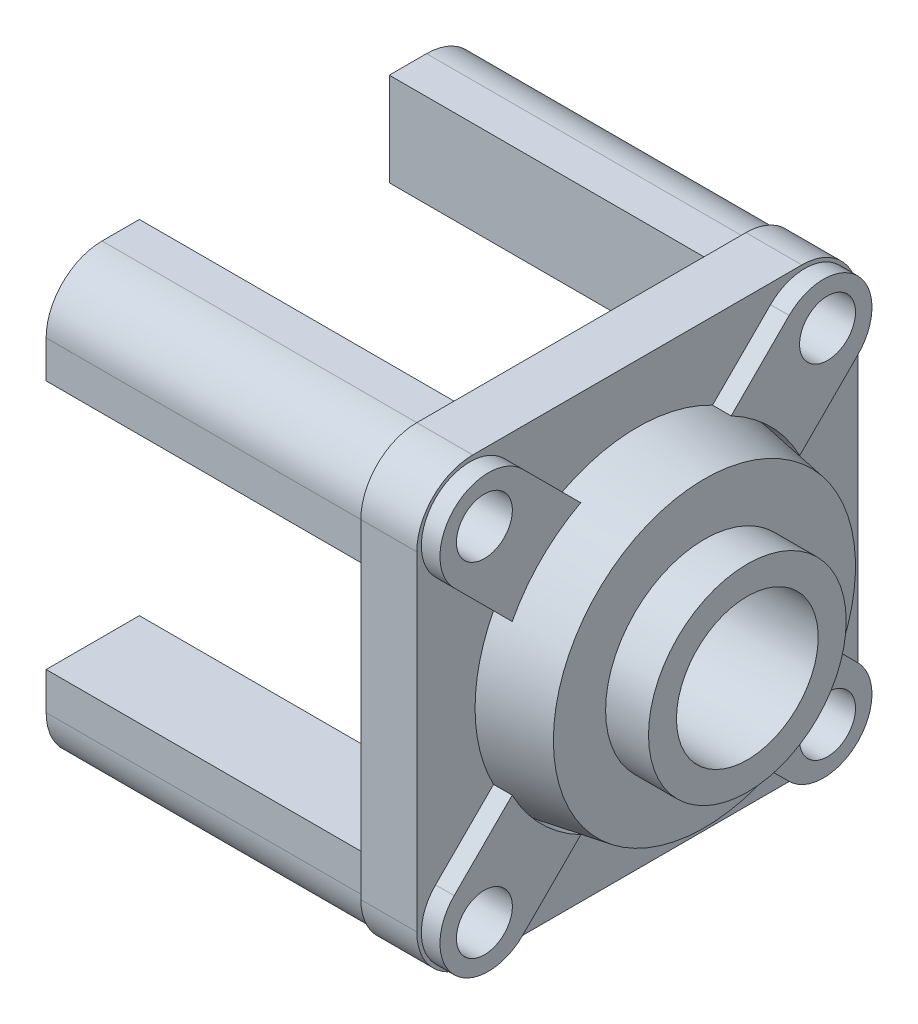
ISO-10303-21;
HEADER;
FILE_DESCRIPTION(('STEP AP214'),'2;1');
FILE_NAME('part.step','',(''),(''),'','','');
FILE_SCHEMA(('AUTOMOTIVE_DESIGN { 1 0 10303 214 1 1 1 1 }'));
ENDSEC;
DATA;
#1=APPLICATION_CONTEXT('core data for automotive mechanical design processes');
#2=APPLICATION_PROTOCOL_DEFINITION('international standard','automotive_design',2000,#1);
#3=PRODUCT_CONTEXT('',#1,'mechanical');
#4=PRODUCT('Part','Part','',(#3));
#5=PRODUCT_RELATED_PRODUCT_CATEGORY('part','',(#4));
#6=PRODUCT_DEFINITION_FORMATION('','',#4);
#7=PRODUCT_DEFINITION_CONTEXT('part definition',#1,'design');
#8=PRODUCT_DEFINITION('design','',#6,#7);
#9=PRODUCT_DEFINITION_SHAPE('','',#8);
#10=(LENGTH_UNIT() NAMED_UNIT(*) SI_UNIT(.MILLI.,.METRE.));
#11=(NAMED_UNIT(*) PLANE_ANGLE_UNIT() SI_UNIT($,.RADIAN.));
#12=(NAMED_UNIT(*) SI_UNIT($,.STERADIAN.) SOLID_ANGLE_UNIT());
#13=UNCERTAINTY_MEASURE_WITH_UNIT(LENGTH_MEASURE(1.E-05),#10,'distance_accuracy_value','');
#14=(GEOMETRIC_REPRESENTATION_CONTEXT(3) GLOBAL_UNCERTAINTY_ASSIGNED_CONTEXT((#13)) GLOBAL_UNIT_ASSIGNED_CONTEXT((#10,
#11,#12)) REPRESENTATION_CONTEXT('',''));
#15=CARTESIAN_POINT('',(0.,0.,0.));
#16=DIRECTION('',(0.,0.,1.));
#17=DIRECTION('',(1.,0.,0.));
#18=AXIS2_PLACEMENT_3D('',#15,#16,#17);
#19=CARTESIAN_POINT('',(0.,81.,0.));
#20=DIRECTION('',(1.,0.,0.));
#21=DIRECTION('',(0.,0.,-1.));
#22=AXIS2_PLACEMENT_3D('',#19,#20,#21);
#23=PLANE('',#22);
#24=DIRECTION('',(0.,-1.,0.));
#25=VECTOR('',#24,1.);
#26=CARTESIAN_POINT('',(0.,-67.,66.999999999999));
#27=LINE('',#26,#25);
#28=CARTESIAN_POINT('',(0.,-67.,66.999999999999));
#29=VERTEX_POINT('',#28);
#30=CARTESIAN_POINT('',(0.,-117.,66.999999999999));
#31=VERTEX_POINT('',#30);
#32=EDGE_CURVE('E332',#29,#31,#27,.T.);
#33=ORIENTED_EDGE('',*,*,#32,.F.);
#34=DIRECTION('',(0.,0.,-1.));
#35=VECTOR('',#34,1.);
#36=CARTESIAN_POINT('',(0.,-67.,116.999999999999));
#37=LINE('',#36,#35);
#38=CARTESIAN_POINT('',(0.,-67.,116.999999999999));
#39=VERTEX_POINT('',#38);
#40=EDGE_CURVE('E347',#39,#29,#37,.T.);
#41=ORIENTED_EDGE('',*,*,#40,.F.);
#42=DIRECTION('',(0.,1.,0.));
#43=VECTOR('',#42,1.);
#44=CARTESIAN_POINT('',(0.,-67.,116.999999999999));
#45=LINE('',#44,#43);
#46=CARTESIAN_POINT('',(0.,-87.,116.999999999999));
#47=VERTEX_POINT('',#46);
#48=EDGE_CURVE('E357',#47,#39,#45,.T.);
#49=ORIENTED_EDGE('',*,*,#48,.F.);
#50=CARTESIAN_POINT('',(0.,-87.,86.999999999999));
#51=DIRECTION('',(1.,0.,0.));
#52=DIRECTION('',(0.,0.,-1.));
#53=AXIS2_PLACEMENT_3D('',#50,#51,#52);
#54=CIRCLE('',#53,30.);
#55=CARTESIAN_POINT('',(0.,-117.,86.999999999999));
#56=VERTEX_POINT('',#55);
#57=EDGE_CURVE('E687',#47,#56,#54,.T.);
#58=ORIENTED_EDGE('',*,*,#57,.T.);
#59=DIRECTION('',(0.,0.,1.));
#60=VECTOR('',#59,1.);
#61=CARTESIAN_POINT('',(0.,-117.,116.999999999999));
#62=LINE('',#61,#60);
#63=EDGE_CURVE('E336',#31,#56,#62,.T.);
#64=ORIENTED_EDGE('',*,*,#63,.F.);
#65=EDGE_LOOP('',(#33,#41,#49,#58,#64));
#66=FACE_BOUND('',#65,.T.);
#67=DIRECTION('',(0.,1.,0.));
#68=VECTOR('',#67,1.);
#69=CARTESIAN_POINT('',(0.,67.,-66.999999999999));
#70=LINE('',#69,#68);
#71=CARTESIAN_POINT('',(0.,67.,-66.999999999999));
#72=VERTEX_POINT('',#71);
#73=CARTESIAN_POINT('',(0.,117.,-66.999999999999));
#74=VERTEX_POINT('',#73);
#75=EDGE_CURVE('E399',#72,#74,#70,.T.);
#76=ORIENTED_EDGE('',*,*,#75,.F.);
#77=DIRECTION('',(0.,0.,1.));
#78=VECTOR('',#77,1.);
#79=CARTESIAN_POINT('',(0.,67.,-116.999999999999));
#80=LINE('',#79,#78);
#81=CARTESIAN_POINT('',(0.,67.,-116.999999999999));
#82=VERTEX_POINT('',#81);
#83=EDGE_CURVE('E404',#82,#72,#80,.T.);
#84=ORIENTED_EDGE('',*,*,#83,.F.);
#85=DIRECTION('',(0.,-1.,0.));
#86=VECTOR('',#85,1.);
#87=CARTESIAN_POINT('',(0.,67.,-116.999999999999));
#88=LINE('',#87,#86);
#89=CARTESIAN_POINT('',(0.,87.,-116.999999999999));
#90=VERTEX_POINT('',#89);
#91=EDGE_CURVE('E417',#90,#82,#88,.T.);
#92=ORIENTED_EDGE('',*,*,#91,.F.);
#93=CARTESIAN_POINT('',(0.,87.,-86.999999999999));
#94=DIRECTION('',(1.,0.,0.));
#95=DIRECTION('',(0.,0.,-1.));
#96=AXIS2_PLACEMENT_3D('',#93,#94,#95);
#97=CIRCLE('',#96,30.);
#98=CARTESIAN_POINT('',(0.,117.,-86.999999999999));
#99=VERTEX_POINT('',#98);
#100=EDGE_CURVE('E691',#90,#99,#97,.T.);
#101=ORIENTED_EDGE('',*,*,#100,.T.);
#102=DIRECTION('',(0.,0.,-1.));
#103=VECTOR('',#102,1.);
#104=CARTESIAN_POINT('',(0.,117.,-116.999999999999));
#105=LINE('',#104,#103);
#106=EDGE_CURVE('E414',#74,#99,#105,.T.);
#107=ORIENTED_EDGE('',*,*,#106,.F.);
#108=EDGE_LOOP('',(#76,#84,#92,#101,#107));
#109=FACE_BOUND('',#108,.T.);
#110=CARTESIAN_POINT('',(0.,0.,0.));
#111=DIRECTION('',(-1.,0.,0.));
#112=DIRECTION('',(0.,0.,1.));
#113=AXIS2_PLACEMENT_3D('',#110,#111,#112);
#114=CIRCLE('',#113,81.);
#115=CARTESIAN_POINT('',(0.,0.,81.));
#116=VERTEX_POINT('',#115);
#117=EDGE_CURVE('E596',#116,#116,#114,.T.);
#118=ORIENTED_EDGE('',*,*,#117,.F.);
#119=EDGE_LOOP('',(#118));
#120=FACE_BOUND('',#119,.T.);
#121=DIRECTION('',(0.,0.,1.));
#122=VECTOR('',#121,1.);
#123=CARTESIAN_POINT('',(0.,-118.25,118.25));
#124=LINE('',#123,#122);
#125=CARTESIAN_POINT('',(0.,-118.25,-88.2499999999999));
#126=VERTEX_POINT('',#125);
#127=CARTESIAN_POINT('',(0.,-118.25,88.25));
#128=VERTEX_POINT('',#127);
#129=EDGE_CURVE('E599',#126,#128,#124,.T.);
#130=ORIENTED_EDGE('',*,*,#129,.T.);
#131=CARTESIAN_POINT('',(0.,-88.25,88.25));
#132=DIRECTION('',(1.,0.,0.));
#133=DIRECTION('',(0.,0.,-1.));
#134=AXIS2_PLACEMENT_3D('',#131,#132,#133);
#135=CIRCLE('',#134,30.);
#136=CARTESIAN_POINT('',(0.,-88.25,118.25));
#137=VERTEX_POINT('',#136);
#138=EDGE_CURVE('E11',#128,#137,#135,.F.);
#139=ORIENTED_EDGE('',*,*,#138,.T.);
#140=DIRECTION('',(0.,1.,0.));
#141=VECTOR('',#140,1.);
#142=CARTESIAN_POINT('',(0.,-118.25,118.25));
#143=LINE('',#142,#141);
#144=CARTESIAN_POINT('',(0.,88.25,118.25));
#145=VERTEX_POINT('',#144);
#146=EDGE_CURVE('E602',#137,#145,#143,.T.);
#147=ORIENTED_EDGE('',*,*,#146,.T.);
#148=CARTESIAN_POINT('',(0.,88.25,88.25));
#149=DIRECTION('',(1.,0.,0.));
#150=DIRECTION('',(0.,0.,-1.));
#151=AXIS2_PLACEMENT_3D('',#148,#149,#150);
#152=CIRCLE('',#151,30.);
#153=CARTESIAN_POINT('',(0.,118.25,88.25));
#154=VERTEX_POINT('',#153);
#155=EDGE_CURVE('E694',#145,#154,#152,.F.);
#156=ORIENTED_EDGE('',*,*,#155,.T.);
#157=DIRECTION('',(0.,0.,-1.));
#158=VECTOR('',#157,1.);
#159=CARTESIAN_POINT('',(0.,118.25,118.25));
#160=LINE('',#159,#158);
#161=CARTESIAN_POINT('',(0.,118.25,-88.2499999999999));
#162=VERTEX_POINT('',#161);
#163=EDGE_CURVE('E587',#154,#162,#160,.T.);
#164=ORIENTED_EDGE('',*,*,#163,.T.);
#165=CARTESIAN_POINT('',(0.,88.25,-88.25));
#166=DIRECTION('',(1.,0.,0.));
#167=DIRECTION('',(0.,0.,-1.));
#168=AXIS2_PLACEMENT_3D('',#165,#166,#167);
#169=CIRCLE('',#168,30.);
#170=CARTESIAN_POINT('',(0.,88.2499999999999,-118.25));
#171=VERTEX_POINT('',#170);
#172=EDGE_CURVE('E696',#162,#171,#169,.F.);
#173=ORIENTED_EDGE('',*,*,#172,.T.);
#174=DIRECTION('',(0.,-1.,0.));
#175=VECTOR('',#174,1.);
#176=CARTESIAN_POINT('',(0.,-118.25,-118.25));
#177=LINE('',#176,#175);
#178=CARTESIAN_POINT('',(0.,-88.25,-118.25));
#179=VERTEX_POINT('',#178);
#180=EDGE_CURVE('E582',#171,#179,#177,.T.);
#181=ORIENTED_EDGE('',*,*,#180,.T.);
#182=CARTESIAN_POINT('',(0.,-88.25,-88.25));
#183=DIRECTION('',(1.,0.,0.));
#184=DIRECTION('',(0.,0.,-1.));
#185=AXIS2_PLACEMENT_3D('',#182,#183,#184);
#186=CIRCLE('',#185,30.);
#187=EDGE_CURVE('E40',#179,#126,#186,.F.);
#188=ORIENTED_EDGE('',*,*,#187,.T.);
#189=EDGE_LOOP('',(#130,#139,#147,#156,#164,#173,#181,#188));
#190=FACE_BOUND('',#189,.T.);
#191=DIRECTION('',(0.,0.,-1.));
#192=VECTOR('',#191,1.);
#193=CARTESIAN_POINT('',(0.,-66.9999999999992,-66.9999999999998));
#194=LINE('',#193,#192);
#195=CARTESIAN_POINT('',(0.,-66.9999999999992,-66.9999999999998));
#196=VERTEX_POINT('',#195);
#197=CARTESIAN_POINT('',(0.,-66.9999999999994,-117.));
#198=VERTEX_POINT('',#197);
#199=EDGE_CURVE('E369',#196,#198,#194,.T.);
#200=ORIENTED_EDGE('',*,*,#199,.F.);
#201=DIRECTION('',(0.,1.,0.));
#202=VECTOR('',#201,1.);
#203=CARTESIAN_POINT('',(0.,-116.999999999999,-66.9999999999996));
#204=LINE('',#203,#202);
#205=CARTESIAN_POINT('',(0.,-116.999999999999,-66.9999999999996));
#206=VERTEX_POINT('',#205);
#207=EDGE_CURVE('E374',#206,#196,#204,.T.);
#208=ORIENTED_EDGE('',*,*,#207,.F.);
#209=DIRECTION('',(0.,0.,1.));
#210=VECTOR('',#209,1.);
#211=CARTESIAN_POINT('',(0.,-116.999999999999,-66.9999999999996));
#212=LINE('',#211,#210);
#213=CARTESIAN_POINT('',(0.,-116.999999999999,-86.9999999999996));
#214=VERTEX_POINT('',#213);
#215=EDGE_CURVE('E387',#214,#206,#212,.T.);
#216=ORIENTED_EDGE('',*,*,#215,.F.);
#217=CARTESIAN_POINT('',(0.,-86.9999999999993,-86.9999999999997));
#218=DIRECTION('',(1.,0.,0.));
#219=DIRECTION('',(0.,0.,-1.));
#220=AXIS2_PLACEMENT_3D('',#217,#218,#219);
#221=CIRCLE('',#220,30.);
#222=CARTESIAN_POINT('',(0.,-86.9999999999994,-117.));
#223=VERTEX_POINT('',#222);
#224=EDGE_CURVE('E689',#214,#223,#221,.T.);
#225=ORIENTED_EDGE('',*,*,#224,.T.);
#226=DIRECTION('',(0.,-1.,0.));
#227=VECTOR('',#226,1.);
#228=CARTESIAN_POINT('',(0.,-116.999999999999,-117.));
#229=LINE('',#228,#227);
#230=EDGE_CURVE('E384',#198,#223,#229,.T.);
#231=ORIENTED_EDGE('',*,*,#230,.F.);
#232=EDGE_LOOP('',(#200,#208,#216,#225,#231));
#233=FACE_BOUND('',#232,.T.);
#234=DIRECTION('',(0.,0.,1.));
#235=VECTOR('',#234,1.);
#236=CARTESIAN_POINT('',(0.,66.9999999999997,66.9999999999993));
#237=LINE('',#236,#235);
#238=CARTESIAN_POINT('',(0.,66.9999999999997,66.9999999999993));
#239=VERTEX_POINT('',#238);
#240=CARTESIAN_POINT('',(0.,67.0000000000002,116.999999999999));
#241=VERTEX_POINT('',#240);
#242=EDGE_CURVE('E331',#239,#241,#237,.T.);
#243=ORIENTED_EDGE('',*,*,#242,.F.);
#244=DIRECTION('',(0.,-1.,0.));
#245=VECTOR('',#244,1.);
#246=CARTESIAN_POINT('',(0.,117.,66.9999999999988));
#247=LINE('',#246,#245);
#248=CARTESIAN_POINT('',(0.,117.,66.9999999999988));
#249=VERTEX_POINT('',#248);
#250=EDGE_CURVE('E328',#249,#239,#247,.T.);
#251=ORIENTED_EDGE('',*,*,#250,.F.);
#252=DIRECTION('',(0.,0.,-1.));
#253=VECTOR('',#252,1.);
#254=CARTESIAN_POINT('',(0.,117.,66.9999999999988));
#255=LINE('',#254,#253);
#256=CARTESIAN_POINT('',(0.,117.,86.9999999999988));
#257=VERTEX_POINT('',#256);
#258=EDGE_CURVE('E1053',#257,#249,#255,.T.);
#259=ORIENTED_EDGE('',*,*,#258,.F.);
#260=CARTESIAN_POINT('',(0.,86.9999999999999,86.9999999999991));
#261=DIRECTION('',(1.,0.,0.));
#262=DIRECTION('',(0.,0.,-1.));
#263=AXIS2_PLACEMENT_3D('',#260,#261,#262);
#264=CIRCLE('',#263,30.);
#265=CARTESIAN_POINT('',(0.,87.0000000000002,116.999999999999));
#266=VERTEX_POINT('',#265);
#267=EDGE_CURVE('E55',#257,#266,#264,.T.);
#268=ORIENTED_EDGE('',*,*,#267,.T.);
#269=DIRECTION('',(0.,1.,0.));
#270=VECTOR('',#269,1.);
#271=CARTESIAN_POINT('',(0.,117.,116.999999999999));
#272=LINE('',#271,#270);
#273=EDGE_CURVE('E1051',#241,#266,#272,.T.);
#274=ORIENTED_EDGE('',*,*,#273,.F.);
#275=EDGE_LOOP('',(#243,#251,#259,#268,#274));
#276=FACE_BOUND('',#275,.T.);
#277=ADVANCED_FACE('F32',(#66,#109,#120,#190,#233,#276),#23,.F.);
#278=CARTESIAN_POINT('',(30.,118.,0.));
#279=DIRECTION('',(-1.,0.,0.));
#280=DIRECTION('',(0.,0.,1.));
#281=AXIS2_PLACEMENT_3D('',#278,#279,#280);
#282=PLANE('',#281);
#283=DIRECTION('',(0.,1.,0.));
#284=VECTOR('',#283,1.);
#285=CARTESIAN_POINT('',(30.,-118.25,118.25));
#286=LINE('',#285,#284);
#287=CARTESIAN_POINT('',(30.,-88.25,118.25));
#288=VERTEX_POINT('',#287);
#289=CARTESIAN_POINT('',(30.,88.25,118.25));
#290=VERTEX_POINT('',#289);
#291=EDGE_CURVE('E590',#288,#290,#286,.T.);
#292=ORIENTED_EDGE('',*,*,#291,.F.);
#293=CARTESIAN_POINT('',(30.,-88.25,88.25));
#294=DIRECTION('',(-1.,0.,0.));
#295=DIRECTION('',(0.,0.,1.));
#296=AXIS2_PLACEMENT_3D('',#293,#294,#295);
#297=CIRCLE('',#296,30.);
#298=CARTESIAN_POINT('',(30.,-118.25,88.25));
#299=VERTEX_POINT('',#298);
#300=EDGE_CURVE('E655',#288,#299,#297,.F.);
#301=ORIENTED_EDGE('',*,*,#300,.T.);
#302=DIRECTION('',(0.,0.,1.));
#303=VECTOR('',#302,1.);
#304=CARTESIAN_POINT('',(30.,-118.25,118.25));
#305=LINE('',#304,#303);
#306=CARTESIAN_POINT('',(30.,-118.25,-88.2499999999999));
#307=VERTEX_POINT('',#306);
#308=EDGE_CURVE('E586',#307,#299,#305,.T.);
#309=ORIENTED_EDGE('',*,*,#308,.F.);
#310=CARTESIAN_POINT('',(30.,-88.25,-88.25));
#311=DIRECTION('',(-1.,0.,0.));
#312=DIRECTION('',(0.,0.,1.));
#313=AXIS2_PLACEMENT_3D('',#310,#311,#312);
#314=CIRCLE('',#313,30.);
#315=CARTESIAN_POINT('',(30.,-88.25,-118.25));
#316=VERTEX_POINT('',#315);
#317=EDGE_CURVE('E653',#307,#316,#314,.F.);
#318=ORIENTED_EDGE('',*,*,#317,.T.);
#319=DIRECTION('',(0.,-1.,0.));
#320=VECTOR('',#319,1.);
#321=CARTESIAN_POINT('',(30.,-118.25,-118.25));
#322=LINE('',#321,#320);
#323=CARTESIAN_POINT('',(30.,88.2499999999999,-118.25));
#324=VERTEX_POINT('',#323);
#325=EDGE_CURVE('E583',#324,#316,#322,.T.);
#326=ORIENTED_EDGE('',*,*,#325,.F.);
#327=CARTESIAN_POINT('',(30.,88.25,-88.25));
#328=DIRECTION('',(-1.,0.,0.));
#329=DIRECTION('',(0.,0.,1.));
#330=AXIS2_PLACEMENT_3D('',#327,#328,#329);
#331=CIRCLE('',#330,30.);
#332=CARTESIAN_POINT('',(30.,118.25,-88.2499999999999));
#333=VERTEX_POINT('',#332);
#334=EDGE_CURVE('E651',#324,#333,#331,.F.);
#335=ORIENTED_EDGE('',*,*,#334,.T.);
#336=DIRECTION('',(0.,0.,-1.));
#337=VECTOR('',#336,1.);
#338=CARTESIAN_POINT('',(30.,118.25,118.25));
#339=LINE('',#338,#337);
#340=CARTESIAN_POINT('',(30.,118.25,88.25));
#341=VERTEX_POINT('',#340);
#342=EDGE_CURVE('E593',#341,#333,#339,.T.);
#343=ORIENTED_EDGE('',*,*,#342,.F.);
#344=CARTESIAN_POINT('',(30.,88.25,88.25));
#345=DIRECTION('',(-1.,0.,0.));
#346=DIRECTION('',(0.,0.,1.));
#347=AXIS2_PLACEMENT_3D('',#344,#345,#346);
#348=CIRCLE('',#347,30.);
#349=EDGE_CURVE('E649',#341,#290,#348,.F.);
#350=ORIENTED_EDGE('',*,*,#349,.T.);
#351=EDGE_LOOP('',(#292,#301,#309,#318,#326,#335,#343,#350));
#352=FACE_BOUND('',#351,.T.);
#353=DIRECTION('',(0.,-0.707106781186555,-0.70710678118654));
#354=VECTOR('',#353,1.);
#355=CARTESIAN_POINT('',(30.,71.4348211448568,108.204373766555));
#356=LINE('',#355,#354);
#357=CARTESIAN_POINT('',(30.,71.4348211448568,108.204373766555));
#358=VERTEX_POINT('',#357);
#359=CARTESIAN_POINT('',(30.,40.3221227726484,77.0916753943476));
#360=VERTEX_POINT('',#359);
#361=EDGE_CURVE('E461',#358,#360,#356,.T.);
#362=ORIENTED_EDGE('',*,*,#361,.F.);
#363=CARTESIAN_POINT('',(30.,89.8195974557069,89.819597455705));
#364=DIRECTION('',(1.,0.,0.));
#365=DIRECTION('',(0.,1.,0.));
#366=AXIS2_PLACEMENT_3D('',#363,#364,#365);
#367=CIRCLE('',#366,26.);
#368=CARTESIAN_POINT('',(30.,108.204373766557,71.4348211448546));
#369=VERTEX_POINT('',#368);
#370=EDGE_CURVE('E445',#369,#358,#367,.T.);
#371=ORIENTED_EDGE('',*,*,#370,.F.);
#372=DIRECTION('',(0.,0.707106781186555,0.70710678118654));
#373=VECTOR('',#372,1.);
#374=CARTESIAN_POINT('',(30.,108.204373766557,71.4348211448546));
#375=LINE('',#374,#373);
#376=CARTESIAN_POINT('',(30.,77.0916753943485,40.3221227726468));
#377=VERTEX_POINT('',#376);
#378=EDGE_CURVE('E452',#377,#369,#375,.T.);
#379=ORIENTED_EDGE('',*,*,#378,.F.);
#380=CARTESIAN_POINT('',(30.,0.,0.));
#381=DIRECTION('',(-1.,0.,0.));
#382=DIRECTION('',(0.,0.,1.));
#383=AXIS2_PLACEMENT_3D('',#380,#381,#382);
#384=CIRCLE('',#383,87.);
#385=CARTESIAN_POINT('',(30.,77.0916753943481,-40.3221227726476));
#386=VERTEX_POINT('',#385);
#387=EDGE_CURVE('E627',#377,#386,#384,.T.);
#388=ORIENTED_EDGE('',*,*,#387,.T.);
#389=DIRECTION('',(0.,-0.707106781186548,0.707106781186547));
#390=VECTOR('',#389,1.);
#391=CARTESIAN_POINT('',(30.,108.204373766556,-71.4348211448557));
#392=LINE('',#391,#390);
#393=CARTESIAN_POINT('',(30.,108.204373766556,-71.4348211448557));
#394=VERTEX_POINT('',#393);
#395=EDGE_CURVE('E566',#394,#386,#392,.T.);
#396=ORIENTED_EDGE('',*,*,#395,.F.);
#397=CARTESIAN_POINT('',(30.,89.8195974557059,-89.8195974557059));
#398=DIRECTION('',(1.,0.,0.));
#399=DIRECTION('',(0.,0.,-1.));
#400=AXIS2_PLACEMENT_3D('',#397,#398,#399);
#401=CIRCLE('',#400,26.);
#402=CARTESIAN_POINT('',(30.,71.4348211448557,-108.204373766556));
#403=VERTEX_POINT('',#402);
#404=EDGE_CURVE('E550',#403,#394,#401,.T.);
#405=ORIENTED_EDGE('',*,*,#404,.F.);
#406=DIRECTION('',(0.,0.707106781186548,-0.707106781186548));
#407=VECTOR('',#406,1.);
#408=CARTESIAN_POINT('',(30.,71.4348211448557,-108.204373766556));
#409=LINE('',#408,#407);
#410=CARTESIAN_POINT('',(30.,40.3221227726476,-77.0916753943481));
#411=VERTEX_POINT('',#410);
#412=EDGE_CURVE('E557',#411,#403,#409,.T.);
#413=ORIENTED_EDGE('',*,*,#412,.F.);
#414=CARTESIAN_POINT('',(30.,-40.3221227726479,-77.0916753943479));
#415=VERTEX_POINT('',#414);
#416=EDGE_CURVE('E632',#411,#415,#384,.T.);
#417=ORIENTED_EDGE('',*,*,#416,.T.);
#418=DIRECTION('',(0.,0.70710678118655,0.707106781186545));
#419=VECTOR('',#418,1.);
#420=CARTESIAN_POINT('',(30.,-71.4348211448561,-108.204373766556));
#421=LINE('',#420,#419);
#422=CARTESIAN_POINT('',(30.,-71.4348211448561,-108.204373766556));
#423=VERTEX_POINT('',#422);
#424=EDGE_CURVE('E527',#423,#415,#421,.T.);
#425=ORIENTED_EDGE('',*,*,#424,.F.);
#426=CARTESIAN_POINT('',(30.,-89.8195974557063,-89.8195974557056));
#427=DIRECTION('',(1.,0.,0.));
#428=DIRECTION('',(0.,-1.,0.));
#429=AXIS2_PLACEMENT_3D('',#426,#427,#428);
#430=CIRCLE('',#429,26.);
#431=CARTESIAN_POINT('',(30.,-108.204373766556,-71.4348211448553));
#432=VERTEX_POINT('',#431);
#433=EDGE_CURVE('E513',#432,#423,#430,.T.);
#434=ORIENTED_EDGE('',*,*,#433,.F.);
#435=DIRECTION('',(0.,-0.70710678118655,-0.707106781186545));
#436=VECTOR('',#435,1.);
#437=CARTESIAN_POINT('',(30.,-108.204373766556,-71.4348211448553));
#438=LINE('',#437,#436);
#439=CARTESIAN_POINT('',(30.,-77.0916753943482,-40.3221227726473));
#440=VERTEX_POINT('',#439);
#441=EDGE_CURVE('E518',#440,#432,#438,.T.);
#442=ORIENTED_EDGE('',*,*,#441,.F.);
#443=CARTESIAN_POINT('',(30.,-77.0916753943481,40.3221227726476));
#444=VERTEX_POINT('',#443);
#445=EDGE_CURVE('E1450',#440,#444,#384,.T.);
#446=ORIENTED_EDGE('',*,*,#445,.T.);
#447=DIRECTION('',(0.,0.707106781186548,-0.707106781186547));
#448=VECTOR('',#447,1.);
#449=CARTESIAN_POINT('',(30.,-108.204373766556,71.4348211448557));
#450=LINE('',#449,#448);
#451=CARTESIAN_POINT('',(30.,-108.204373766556,71.4348211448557));
#452=VERTEX_POINT('',#451);
#453=EDGE_CURVE('E494',#452,#444,#450,.T.);
#454=ORIENTED_EDGE('',*,*,#453,.F.);
#455=CARTESIAN_POINT('',(30.,-89.8195974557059,89.8195974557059));
#456=DIRECTION('',(1.,0.,0.));
#457=DIRECTION('',(0.,0.,1.));
#458=AXIS2_PLACEMENT_3D('',#455,#456,#457);
#459=CIRCLE('',#458,26.);
#460=CARTESIAN_POINT('',(30.,-71.4348211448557,108.204373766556));
#461=VERTEX_POINT('',#460);
#462=EDGE_CURVE('E480',#461,#452,#459,.T.);
#463=ORIENTED_EDGE('',*,*,#462,.F.);
#464=DIRECTION('',(0.,-0.707106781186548,0.707106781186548));
#465=VECTOR('',#464,1.);
#466=CARTESIAN_POINT('',(30.,-71.4348211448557,108.204373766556));
#467=LINE('',#466,#465);
#468=CARTESIAN_POINT('',(30.,-40.3221227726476,77.0916753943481));
#469=VERTEX_POINT('',#468);
#470=EDGE_CURVE('E485',#469,#461,#467,.T.);
#471=ORIENTED_EDGE('',*,*,#470,.F.);
#472=EDGE_CURVE('E1449',#469,#360,#384,.T.);
#473=ORIENTED_EDGE('',*,*,#472,.T.);
#474=EDGE_LOOP('',(#362,#371,#379,#388,#396,#405,#413,#417,#425,#434,#442,#446,#454,#463,#471,#473));
#475=FACE_BOUND('',#474,.T.);
#476=ADVANCED_FACE('F713',(#352,#475),#282,.F.);
#477=CARTESIAN_POINT('',(66.,0.,0.));
#478=DIRECTION('',(-1.,0.,0.));
#479=DIRECTION('',(0.,0.,1.));
#480=AXIS2_PLACEMENT_3D('',#477,#478,#479);
#481=CONICAL_SURFACE('',#480,81.,0.165148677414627);
#482=EDGE_CURVE('E628',#386,#411,#384,.T.);
#483=ORIENTED_EDGE('',*,*,#482,.F.);
#484=ORIENTED_EDGE('',*,*,#387,.F.);
#485=CARTESIAN_POINT('',(30.,0.,0.));
#486=DIRECTION('',(-1.,0.,0.));
#487=DIRECTION('',(0.,-1.,0.));
#488=AXIS2_PLACEMENT_3D('',#485,#486,#487);
#489=CIRCLE('',#488,87.);
#490=EDGE_CURVE('E464',#360,#377,#489,.T.);
#491=ORIENTED_EDGE('',*,*,#490,.F.);
#492=ORIENTED_EDGE('',*,*,#472,.F.);
#493=CARTESIAN_POINT('',(30.,0.,0.));
#494=DIRECTION('',(-1.,0.,0.));
#495=DIRECTION('',(0.,0.,-1.));
#496=AXIS2_PLACEMENT_3D('',#493,#494,#495);
#497=CIRCLE('',#496,87.);
#498=EDGE_CURVE('E497',#444,#469,#497,.T.);
#499=ORIENTED_EDGE('',*,*,#498,.F.);
#500=ORIENTED_EDGE('',*,*,#445,.F.);
#501=CARTESIAN_POINT('',(30.,0.,0.));
#502=DIRECTION('',(-1.,0.,0.));
#503=DIRECTION('',(0.,1.,0.));
#504=AXIS2_PLACEMENT_3D('',#501,#502,#503);
#505=CIRCLE('',#504,87.);
#506=EDGE_CURVE('E530',#415,#440,#505,.T.);
#507=ORIENTED_EDGE('',*,*,#506,.F.);
#508=ORIENTED_EDGE('',*,*,#416,.F.);
#509=EDGE_LOOP('',(#483,#484,#491,#492,#499,#500,#507,#508));
#510=FACE_BOUND('',#509,.T.);
#511=CARTESIAN_POINT('',(66.,0.,0.));
#512=DIRECTION('',(-1.,0.,0.));
#513=DIRECTION('',(0.,0.,1.));
#514=AXIS2_PLACEMENT_3D('',#511,#512,#513);
#515=CIRCLE('',#514,81.);
#516=CARTESIAN_POINT('',(66.,0.,81.));
#517=VERTEX_POINT('',#516);
#518=EDGE_CURVE('E624',#517,#517,#515,.T.);
#519=ORIENTED_EDGE('',*,*,#518,.T.);
#520=EDGE_LOOP('',(#519));
#521=FACE_BOUND('',#520,.T.);
#522=ADVANCED_FACE('F755',(#510,#521),#481,.T.);
#523=CARTESIAN_POINT('',(66.,81.,0.));
#524=DIRECTION('',(-1.,0.,0.));
#525=DIRECTION('',(0.,0.,1.));
#526=AXIS2_PLACEMENT_3D('',#523,#524,#525);
#527=PLANE('',#526);
#528=ORIENTED_EDGE('',*,*,#518,.F.);
#529=EDGE_LOOP('',(#528));
#530=FACE_BOUND('',#529,.T.);
#531=CARTESIAN_POINT('',(66.,0.,0.));
#532=DIRECTION('',(-1.,0.,0.));
#533=DIRECTION('',(0.,0.,1.));
#534=AXIS2_PLACEMENT_3D('',#531,#532,#533);
#535=CIRCLE('',#534,53.);
#536=CARTESIAN_POINT('',(66.,0.,53.));
#537=VERTEX_POINT('',#536);
#538=EDGE_CURVE('E621',#537,#537,#535,.T.);
#539=ORIENTED_EDGE('',*,*,#538,.T.);
#540=EDGE_LOOP('',(#539));
#541=FACE_BOUND('',#540,.T.);
#542=ADVANCED_FACE('F761',(#530,#541),#527,.F.);
#543=CARTESIAN_POINT('',(0.,0.,0.));
#544=DIRECTION('',(-1.,0.,0.));
#545=DIRECTION('',(0.,0.,1.));
#546=AXIS2_PLACEMENT_3D('',#543,#544,#545);
#547=CYLINDRICAL_SURFACE('',#546,53.);
#548=ORIENTED_EDGE('',*,*,#538,.F.);
#549=EDGE_LOOP('',(#548));
#550=FACE_BOUND('',#549,.T.);
#551=CARTESIAN_POINT('',(89.,0.,0.));
#552=DIRECTION('',(-1.,0.,0.));
#553=DIRECTION('',(0.,0.,1.));
#554=AXIS2_PLACEMENT_3D('',#551,#552,#553);
#555=CIRCLE('',#554,53.);
#556=CARTESIAN_POINT('',(89.,0.,53.));
#557=VERTEX_POINT('',#556);
#558=EDGE_CURVE('E618',#557,#557,#555,.T.);
#559=ORIENTED_EDGE('',*,*,#558,.T.);
#560=EDGE_LOOP('',(#559));
#561=FACE_BOUND('',#560,.T.);
#562=ADVANCED_FACE('F765',(#550,#561),#547,.T.);
#563=CARTESIAN_POINT('',(89.,53.,0.));
#564=DIRECTION('',(-1.,0.,0.));
#565=DIRECTION('',(0.,0.,1.));
#566=AXIS2_PLACEMENT_3D('',#563,#564,#565);
#567=PLANE('',#566);
#568=ORIENTED_EDGE('',*,*,#558,.F.);
#569=EDGE_LOOP('',(#568));
#570=FACE_BOUND('',#569,.T.);
#571=CARTESIAN_POINT('',(89.,0.,0.));
#572=DIRECTION('',(-1.,0.,0.));
#573=DIRECTION('',(0.,0.,1.));
#574=AXIS2_PLACEMENT_3D('',#571,#572,#573);
#575=CIRCLE('',#574,38.);
#576=CARTESIAN_POINT('',(89.,0.,38.));
#577=VERTEX_POINT('',#576);
#578=EDGE_CURVE('E615',#577,#577,#575,.T.);
#579=ORIENTED_EDGE('',*,*,#578,.T.);
#580=EDGE_LOOP('',(#579));
#581=FACE_BOUND('',#580,.T.);
#582=ADVANCED_FACE('F769',(#570,#581),#567,.F.);
#583=CARTESIAN_POINT('',(0.,0.,0.));
#584=DIRECTION('',(-1.,0.,0.));
#585=DIRECTION('',(0.,0.,1.));
#586=AXIS2_PLACEMENT_3D('',#583,#584,#585);
#587=CYLINDRICAL_SURFACE('',#586,38.);
#588=ORIENTED_EDGE('',*,*,#578,.F.);
#589=EDGE_LOOP('',(#588));
#590=FACE_BOUND('',#589,.T.);
#591=CARTESIAN_POINT('',(8.00000000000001,0.,0.));
#592=DIRECTION('',(-1.,0.,0.));
#593=DIRECTION('',(0.,0.,1.));
#594=AXIS2_PLACEMENT_3D('',#591,#592,#593);
#595=CIRCLE('',#594,38.);
#596=CARTESIAN_POINT('',(8.00000000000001,0.,38.));
#597=VERTEX_POINT('',#596);
#598=EDGE_CURVE('E612',#597,#597,#595,.T.);
#599=ORIENTED_EDGE('',*,*,#598,.T.);
#600=EDGE_LOOP('',(#599));
#601=FACE_BOUND('',#600,.T.);
#602=ADVANCED_FACE('F773',(#590,#601),#587,.F.);
#603=CARTESIAN_POINT('',(8.,81.,0.));
#604=DIRECTION('',(1.,0.,0.));
#605=DIRECTION('',(0.,0.,-1.));
#606=AXIS2_PLACEMENT_3D('',#603,#604,#605);
#607=PLANE('',#606);
#608=ORIENTED_EDGE('',*,*,#598,.F.);
#609=EDGE_LOOP('',(#608));
#610=FACE_BOUND('',#609,.T.);
#611=CARTESIAN_POINT('',(8.,0.,0.));
#612=DIRECTION('',(-1.,0.,0.));
#613=DIRECTION('',(0.,0.,1.));
#614=AXIS2_PLACEMENT_3D('',#611,#612,#613);
#615=CIRCLE('',#614,81.);
#616=CARTESIAN_POINT('',(8.,0.,81.));
#617=VERTEX_POINT('',#616);
#618=EDGE_CURVE('E609',#617,#617,#615,.T.);
#619=ORIENTED_EDGE('',*,*,#618,.T.);
#620=EDGE_LOOP('',(#619));
#621=FACE_BOUND('',#620,.T.);
#622=ADVANCED_FACE('F777',(#610,#621),#607,.F.);
#623=CARTESIAN_POINT('',(0.,0.,0.));
#624=DIRECTION('',(-1.,0.,0.));
#625=DIRECTION('',(0.,0.,1.));
#626=AXIS2_PLACEMENT_3D('',#623,#624,#625);
#627=CYLINDRICAL_SURFACE('',#626,81.);
#628=ORIENTED_EDGE('',*,*,#618,.F.);
#629=EDGE_LOOP('',(#628));
#630=FACE_BOUND('',#629,.T.);
#631=ORIENTED_EDGE('',*,*,#117,.T.);
#632=EDGE_LOOP('',(#631));
#633=FACE_BOUND('',#632,.T.);
#634=ADVANCED_FACE('F781',(#630,#633),#627,.F.);
#635=CARTESIAN_POINT('',(30.,-118.25,-118.25));
#636=DIRECTION('',(0.,0.,-1.));
#637=DIRECTION('',(-1.,0.,0.));
#638=AXIS2_PLACEMENT_3D('',#635,#636,#637);
#639=PLANE('',#638);
#640=ORIENTED_EDGE('',*,*,#325,.T.);
#641=DIRECTION('',(-1.,0.,0.));
#642=VECTOR('',#641,1.);
#643=CARTESIAN_POINT('',(30.,-88.25,-118.25));
#644=LINE('',#643,#642);
#645=EDGE_CURVE('E666',#316,#179,#644,.T.);
#646=ORIENTED_EDGE('',*,*,#645,.T.);
#647=ORIENTED_EDGE('',*,*,#180,.F.);
#648=DIRECTION('',(-1.,0.,0.));
#649=VECTOR('',#648,1.);
#650=CARTESIAN_POINT('',(30.,88.25,-118.25));
#651=LINE('',#650,#649);
#652=EDGE_CURVE('E664',#171,#324,#651,.F.);
#653=ORIENTED_EDGE('',*,*,#652,.T.);
#654=EDGE_LOOP('',(#640,#646,#647,#653));
#655=FACE_BOUND('',#654,.T.);
#656=ADVANCED_FACE('F717',(#655),#639,.T.);
#657=CARTESIAN_POINT('',(30.,118.25,118.25));
#658=DIRECTION('',(0.,1.,0.));
#659=DIRECTION('',(0.,0.,1.));
#660=AXIS2_PLACEMENT_3D('',#657,#658,#659);
#661=PLANE('',#660);
#662=ORIENTED_EDGE('',*,*,#342,.T.);
#663=DIRECTION('',(-1.,0.,0.));
#664=VECTOR('',#663,1.);
#665=CARTESIAN_POINT('',(30.,118.25,-88.25));
#666=LINE('',#665,#664);
#667=EDGE_CURVE('E678',#333,#162,#666,.T.);
#668=ORIENTED_EDGE('',*,*,#667,.T.);
#669=ORIENTED_EDGE('',*,*,#163,.F.);
#670=DIRECTION('',(-1.,0.,0.));
#671=VECTOR('',#670,1.);
#672=CARTESIAN_POINT('',(30.,118.25,88.25));
#673=LINE('',#672,#671);
#674=EDGE_CURVE('E676',#154,#341,#673,.F.);
#675=ORIENTED_EDGE('',*,*,#674,.T.);
#676=EDGE_LOOP('',(#662,#668,#669,#675));
#677=FACE_BOUND('',#676,.T.);
#678=ADVANCED_FACE('F725',(#677),#661,.T.);
#679=CARTESIAN_POINT('',(30.,-118.25,118.25));
#680=DIRECTION('',(0.,0.,1.));
#681=DIRECTION('',(1.,0.,0.));
#682=AXIS2_PLACEMENT_3D('',#679,#680,#681);
#683=PLANE('',#682);
#684=ORIENTED_EDGE('',*,*,#146,.F.);
#685=DIRECTION('',(-1.,0.,0.));
#686=VECTOR('',#685,1.);
#687=CARTESIAN_POINT('',(30.,-88.25,118.25));
#688=LINE('',#687,#686);
#689=EDGE_CURVE('E647',#137,#288,#688,.F.);
#690=ORIENTED_EDGE('',*,*,#689,.T.);
#691=ORIENTED_EDGE('',*,*,#291,.T.);
#692=DIRECTION('',(-1.,0.,0.));
#693=VECTOR('',#692,1.);
#694=CARTESIAN_POINT('',(30.,88.25,118.25));
#695=LINE('',#694,#693);
#696=EDGE_CURVE('E644',#290,#145,#695,.T.);
#697=ORIENTED_EDGE('',*,*,#696,.T.);
#698=EDGE_LOOP('',(#684,#690,#691,#697));
#699=FACE_BOUND('',#698,.T.);
#700=ADVANCED_FACE('F733',(#699),#683,.T.);
#701=CARTESIAN_POINT('',(30.,-118.25,118.25));
#702=DIRECTION('',(0.,-1.,0.));
#703=DIRECTION('',(0.,0.,-1.));
#704=AXIS2_PLACEMENT_3D('',#701,#702,#703);
#705=PLANE('',#704);
#706=ORIENTED_EDGE('',*,*,#308,.T.);
#707=DIRECTION('',(-1.,0.,0.));
#708=VECTOR('',#707,1.);
#709=CARTESIAN_POINT('',(30.,-118.25,88.25));
#710=LINE('',#709,#708);
#711=EDGE_CURVE('E641',#299,#128,#710,.T.);
#712=ORIENTED_EDGE('',*,*,#711,.T.);
#713=ORIENTED_EDGE('',*,*,#129,.F.);
#714=DIRECTION('',(-1.,0.,0.));
#715=VECTOR('',#714,1.);
#716=CARTESIAN_POINT('',(30.,-118.25,-88.25));
#717=LINE('',#716,#715);
#718=EDGE_CURVE('E639',#126,#307,#717,.F.);
#719=ORIENTED_EDGE('',*,*,#718,.T.);
#720=EDGE_LOOP('',(#706,#712,#713,#719));
#721=FACE_BOUND('',#720,.T.);
#722=ADVANCED_FACE('F705',(#721),#705,.T.);
#723=CARTESIAN_POINT('',(40.,89.8195974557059,-89.8195974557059));
#724=DIRECTION('',(-1.,0.,0.));
#725=DIRECTION('',(0.,0.,1.));
#726=AXIS2_PLACEMENT_3D('',#723,#724,#725);
#727=CYLINDRICAL_SURFACE('',#726,26.);
#728=ORIENTED_EDGE('',*,*,#404,.T.);
#729=DIRECTION('',(-1.,0.,0.));
#730=VECTOR('',#729,1.);
#731=CARTESIAN_POINT('',(40.,108.204373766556,-71.4348211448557));
#732=LINE('',#731,#730);
#733=CARTESIAN_POINT('',(40.,108.204373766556,-71.4348211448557));
#734=VERTEX_POINT('',#733);
#735=EDGE_CURVE('E579',#734,#394,#732,.T.);
#736=ORIENTED_EDGE('',*,*,#735,.F.);
#737=CARTESIAN_POINT('',(40.,89.8195974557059,-89.8195974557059));
#738=DIRECTION('',(1.,0.,0.));
#739=DIRECTION('',(0.,0.,-1.));
#740=AXIS2_PLACEMENT_3D('',#737,#738,#739);
#741=CIRCLE('',#740,26.);
#742=CARTESIAN_POINT('',(40.,71.4348211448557,-108.204373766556));
#743=VERTEX_POINT('',#742);
#744=EDGE_CURVE('E553',#743,#734,#741,.T.);
#745=ORIENTED_EDGE('',*,*,#744,.F.);
#746=DIRECTION('',(-1.,0.,0.));
#747=VECTOR('',#746,1.);
#748=CARTESIAN_POINT('',(40.,71.4348211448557,-108.204373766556));
#749=LINE('',#748,#747);
#750=EDGE_CURVE('E563',#743,#403,#749,.T.);
#751=ORIENTED_EDGE('',*,*,#750,.T.);
#752=EDGE_LOOP('',(#728,#736,#745,#751));
#753=FACE_BOUND('',#752,.T.);
#754=ADVANCED_FACE('F790',(#753),#727,.T.);
#755=CARTESIAN_POINT('',(40.,108.204373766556,-71.4348211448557));
#756=DIRECTION('',(0.,-0.707106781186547,-0.707106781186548));
#757=DIRECTION('',(0.,0.707106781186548,-0.707106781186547));
#758=AXIS2_PLACEMENT_3D('',#755,#756,#757);
#759=PLANE('',#758);
#760=ORIENTED_EDGE('',*,*,#395,.T.);
#761=DIRECTION('',(-1.,0.,0.));
#762=VECTOR('',#761,1.);
#763=CARTESIAN_POINT('',(40.,77.0916753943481,-40.3221227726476));
#764=LINE('',#763,#762);
#765=CARTESIAN_POINT('',(40.,77.0916753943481,-40.3221227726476));
#766=VERTEX_POINT('',#765);
#767=EDGE_CURVE('E576',#766,#386,#764,.T.);
#768=ORIENTED_EDGE('',*,*,#767,.F.);
#769=DIRECTION('',(0.,-0.707106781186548,0.707106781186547));
#770=VECTOR('',#769,1.);
#771=CARTESIAN_POINT('',(40.,108.204373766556,-71.4348211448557));
#772=LINE('',#771,#770);
#773=EDGE_CURVE('E556',#734,#766,#772,.T.);
#774=ORIENTED_EDGE('',*,*,#773,.F.);
#775=ORIENTED_EDGE('',*,*,#735,.T.);
#776=EDGE_LOOP('',(#760,#768,#774,#775));
#777=FACE_BOUND('',#776,.T.);
#778=ADVANCED_FACE('F797',(#777),#759,.F.);
#779=CARTESIAN_POINT('',(40.,0.,0.));
#780=DIRECTION('',(-1.,0.,0.));
#781=DIRECTION('',(0.,0.,1.));
#782=AXIS2_PLACEMENT_3D('',#779,#780,#781);
#783=CYLINDRICAL_SURFACE('',#782,87.);
#784=ORIENTED_EDGE('',*,*,#482,.T.);
#785=DIRECTION('',(-1.,0.,0.));
#786=VECTOR('',#785,1.);
#787=CARTESIAN_POINT('',(40.,40.3221227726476,-77.0916753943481));
#788=LINE('',#787,#786);
#789=CARTESIAN_POINT('',(40.,40.3221227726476,-77.0916753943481));
#790=VERTEX_POINT('',#789);
#791=EDGE_CURVE('E573',#790,#411,#788,.T.);
#792=ORIENTED_EDGE('',*,*,#791,.F.);
#793=CARTESIAN_POINT('',(40.,0.,0.));
#794=DIRECTION('',(-1.,0.,0.));
#795=DIRECTION('',(0.,0.,1.));
#796=AXIS2_PLACEMENT_3D('',#793,#794,#795);
#797=CIRCLE('',#796,87.);
#798=EDGE_CURVE('E559',#766,#790,#797,.T.);
#799=ORIENTED_EDGE('',*,*,#798,.F.);
#800=ORIENTED_EDGE('',*,*,#767,.T.);
#801=EDGE_LOOP('',(#784,#792,#799,#800));
#802=FACE_BOUND('',#801,.T.);
#803=ADVANCED_FACE('F801',(#802),#783,.F.);
#804=CARTESIAN_POINT('',(40.,71.4348211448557,-108.204373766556));
#805=DIRECTION('',(0.,0.707106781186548,0.707106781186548));
#806=DIRECTION('',(0.,-0.707106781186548,0.707106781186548));
#807=AXIS2_PLACEMENT_3D('',#804,#805,#806);
#808=PLANE('',#807);
#809=ORIENTED_EDGE('',*,*,#412,.T.);
#810=ORIENTED_EDGE('',*,*,#750,.F.);
#811=DIRECTION('',(0.,0.707106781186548,-0.707106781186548));
#812=VECTOR('',#811,1.);
#813=CARTESIAN_POINT('',(40.,71.4348211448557,-108.204373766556));
#814=LINE('',#813,#812);
#815=EDGE_CURVE('E561',#790,#743,#814,.T.);
#816=ORIENTED_EDGE('',*,*,#815,.F.);
#817=ORIENTED_EDGE('',*,*,#791,.T.);
#818=EDGE_LOOP('',(#809,#810,#816,#817));
#819=FACE_BOUND('',#818,.T.);
#820=ADVANCED_FACE('F805',(#819),#808,.F.);
#821=CARTESIAN_POINT('',(40.,89.8195974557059,-89.8195974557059));
#822=DIRECTION('',(1.,0.,0.));
#823=DIRECTION('',(0.,0.,-1.));
#824=AXIS2_PLACEMENT_3D('',#821,#822,#823);
#825=PLANE('',#824);
#826=CARTESIAN_POINT('',(40.,92.,-91.999999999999));
#827=DIRECTION('',(1.,0.,0.));
#828=DIRECTION('',(0.,0.,-1.));
#829=AXIS2_PLACEMENT_3D('',#826,#827,#828);
#830=CIRCLE('',#829,15.);
#831=CARTESIAN_POINT('',(40.,92.,-106.999999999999));
#832=VERTEX_POINT('',#831);
#833=EDGE_CURVE('E546',#832,#832,#830,.T.);
#834=ORIENTED_EDGE('',*,*,#833,.F.);
#835=EDGE_LOOP('',(#834));
#836=FACE_BOUND('',#835,.T.);
#837=ORIENTED_EDGE('',*,*,#744,.T.);
#838=ORIENTED_EDGE('',*,*,#773,.T.);
#839=ORIENTED_EDGE('',*,*,#798,.T.);
#840=ORIENTED_EDGE('',*,*,#815,.T.);
#841=EDGE_LOOP('',(#837,#838,#839,#840));
#842=FACE_BOUND('',#841,.T.);
#843=ADVANCED_FACE('F809',(#836,#842),#825,.T.);
#844=CARTESIAN_POINT('',(0.,92.,-91.999999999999));
#845=DIRECTION('',(1.,0.,0.));
#846=DIRECTION('',(0.,0.,-1.));
#847=AXIS2_PLACEMENT_3D('',#844,#845,#846);
#848=CYLINDRICAL_SURFACE('',#847,15.);
#849=CARTESIAN_POINT('',(0.,92.,-91.999999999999));
#850=DIRECTION('',(1.,0.,0.));
#851=DIRECTION('',(0.,0.,-1.));
#852=AXIS2_PLACEMENT_3D('',#849,#850,#851);
#853=CIRCLE('',#852,15.);
#854=CARTESIAN_POINT('',(0.,92.,-106.999999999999));
#855=VERTEX_POINT('',#854);
#856=EDGE_CURVE('E547',#855,#855,#853,.T.);
#857=ORIENTED_EDGE('',*,*,#856,.F.);
#858=EDGE_LOOP('',(#857));
#859=FACE_BOUND('',#858,.T.);
#860=ORIENTED_EDGE('',*,*,#833,.T.);
#861=EDGE_LOOP('',(#860));
#862=FACE_BOUND('',#861,.T.);
#863=ADVANCED_FACE('F813',(#859,#862),#848,.F.);
#864=CARTESIAN_POINT('',(40.,-89.8195974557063,-89.8195974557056));
#865=DIRECTION('',(-1.,0.,0.));
#866=DIRECTION('',(0.,0.,1.));
#867=AXIS2_PLACEMENT_3D('',#864,#865,#866);
#868=CYLINDRICAL_SURFACE('',#867,26.);
#869=ORIENTED_EDGE('',*,*,#433,.T.);
#870=DIRECTION('',(-1.,0.,0.));
#871=VECTOR('',#870,1.);
#872=CARTESIAN_POINT('',(40.,-71.4348211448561,-108.204373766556));
#873=LINE('',#872,#871);
#874=CARTESIAN_POINT('',(40.,-71.4348211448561,-108.204373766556));
#875=VERTEX_POINT('',#874);
#876=EDGE_CURVE('E543',#875,#423,#873,.T.);
#877=ORIENTED_EDGE('',*,*,#876,.F.);
#878=CARTESIAN_POINT('',(40.,-89.8195974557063,-89.8195974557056));
#879=DIRECTION('',(1.,0.,0.));
#880=DIRECTION('',(0.,-1.,0.));
#881=AXIS2_PLACEMENT_3D('',#878,#879,#880);
#882=CIRCLE('',#881,26.);
#883=CARTESIAN_POINT('',(40.,-108.204373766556,-71.4348211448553));
#884=VERTEX_POINT('',#883);
#885=EDGE_CURVE('E514',#884,#875,#882,.T.);
#886=ORIENTED_EDGE('',*,*,#885,.F.);
#887=DIRECTION('',(-1.,0.,0.));
#888=VECTOR('',#887,1.);
#889=CARTESIAN_POINT('',(40.,-108.204373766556,-71.4348211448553));
#890=LINE('',#889,#888);
#891=EDGE_CURVE('E524',#884,#432,#890,.T.);
#892=ORIENTED_EDGE('',*,*,#891,.T.);
#893=EDGE_LOOP('',(#869,#877,#886,#892));
#894=FACE_BOUND('',#893,.T.);
#895=ADVANCED_FACE('F817',(#894),#868,.T.);
#896=CARTESIAN_POINT('',(40.,-71.4348211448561,-108.204373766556));
#897=DIRECTION('',(0.,-0.707106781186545,0.70710678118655));
#898=DIRECTION('',(0.,-0.70710678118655,-0.707106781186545));
#899=AXIS2_PLACEMENT_3D('',#896,#897,#898);
#900=PLANE('',#899);
#901=ORIENTED_EDGE('',*,*,#424,.T.);
#902=DIRECTION('',(-1.,0.,0.));
#903=VECTOR('',#902,1.);
#904=CARTESIAN_POINT('',(40.,-40.3221227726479,-77.0916753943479));
#905=LINE('',#904,#903);
#906=CARTESIAN_POINT('',(40.,-40.3221227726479,-77.0916753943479));
#907=VERTEX_POINT('',#906);
#908=EDGE_CURVE('E540',#907,#415,#905,.T.);
#909=ORIENTED_EDGE('',*,*,#908,.F.);
#910=DIRECTION('',(0.,0.70710678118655,0.707106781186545));
#911=VECTOR('',#910,1.);
#912=CARTESIAN_POINT('',(40.,-71.4348211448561,-108.204373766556));
#913=LINE('',#912,#911);
#914=EDGE_CURVE('E517',#875,#907,#913,.T.);
#915=ORIENTED_EDGE('',*,*,#914,.F.);
#916=ORIENTED_EDGE('',*,*,#876,.T.);
#917=EDGE_LOOP('',(#901,#909,#915,#916));
#918=FACE_BOUND('',#917,.T.);
#919=ADVANCED_FACE('F821',(#918),#900,.F.);
#920=CARTESIAN_POINT('',(40.,0.,0.));
#921=DIRECTION('',(-1.,0.,0.));
#922=DIRECTION('',(0.,0.,1.));
#923=AXIS2_PLACEMENT_3D('',#920,#921,#922);
#924=CYLINDRICAL_SURFACE('',#923,87.);
#925=ORIENTED_EDGE('',*,*,#506,.T.);
#926=DIRECTION('',(-1.,0.,0.));
#927=VECTOR('',#926,1.);
#928=CARTESIAN_POINT('',(40.,-77.0916753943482,-40.3221227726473));
#929=LINE('',#928,#927);
#930=CARTESIAN_POINT('',(40.,-77.0916753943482,-40.3221227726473));
#931=VERTEX_POINT('',#930);
#932=EDGE_CURVE('E537',#931,#440,#929,.T.);
#933=ORIENTED_EDGE('',*,*,#932,.F.);
#934=CARTESIAN_POINT('',(40.,0.,0.));
#935=DIRECTION('',(-1.,0.,0.));
#936=DIRECTION('',(0.,1.,0.));
#937=AXIS2_PLACEMENT_3D('',#934,#935,#936);
#938=CIRCLE('',#937,87.);
#939=EDGE_CURVE('E520',#907,#931,#938,.T.);
#940=ORIENTED_EDGE('',*,*,#939,.F.);
#941=ORIENTED_EDGE('',*,*,#908,.T.);
#942=EDGE_LOOP('',(#925,#933,#940,#941));
#943=FACE_BOUND('',#942,.T.);
#944=ADVANCED_FACE('F825',(#943),#924,.F.);
#945=CARTESIAN_POINT('',(40.,-108.204373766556,-71.4348211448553));
#946=DIRECTION('',(0.,0.707106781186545,-0.70710678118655));
#947=DIRECTION('',(0.,0.70710678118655,0.707106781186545));
#948=AXIS2_PLACEMENT_3D('',#945,#946,#947);
#949=PLANE('',#948);
#950=ORIENTED_EDGE('',*,*,#441,.T.);
#951=ORIENTED_EDGE('',*,*,#891,.F.);
#952=DIRECTION('',(0.,-0.70710678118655,-0.707106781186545));
#953=VECTOR('',#952,1.);
#954=CARTESIAN_POINT('',(40.,-108.204373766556,-71.4348211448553));
#955=LINE('',#954,#953);
#956=EDGE_CURVE('E522',#931,#884,#955,.T.);
#957=ORIENTED_EDGE('',*,*,#956,.F.);
#958=ORIENTED_EDGE('',*,*,#932,.T.);
#959=EDGE_LOOP('',(#950,#951,#957,#958));
#960=FACE_BOUND('',#959,.T.);
#961=ADVANCED_FACE('F829',(#960),#949,.F.);
#962=CARTESIAN_POINT('',(40.,-89.8195974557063,-89.8195974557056));
#963=DIRECTION('',(1.,0.,0.));
#964=DIRECTION('',(0.,-1.,0.));
#965=AXIS2_PLACEMENT_3D('',#962,#963,#964);
#966=PLANE('',#965);
#967=CARTESIAN_POINT('',(40.,-91.9999999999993,-91.9999999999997));
#968=DIRECTION('',(1.,0.,0.));
#969=DIRECTION('',(0.,-1.,0.));
#970=AXIS2_PLACEMENT_3D('',#967,#968,#969);
#971=CIRCLE('',#970,15.);
#972=CARTESIAN_POINT('',(40.,-106.999999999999,-91.9999999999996));
#973=VERTEX_POINT('',#972);
#974=EDGE_CURVE('E433',#973,#973,#971,.T.);
#975=ORIENTED_EDGE('',*,*,#974,.F.);
#976=EDGE_LOOP('',(#975));
#977=FACE_BOUND('',#976,.T.);
#978=ORIENTED_EDGE('',*,*,#885,.T.);
#979=ORIENTED_EDGE('',*,*,#914,.T.);
#980=ORIENTED_EDGE('',*,*,#939,.T.);
#981=ORIENTED_EDGE('',*,*,#956,.T.);
#982=EDGE_LOOP('',(#978,#979,#980,#981));
#983=FACE_BOUND('',#982,.T.);
#984=ADVANCED_FACE('F833',(#977,#983),#966,.T.);
#985=CARTESIAN_POINT('',(40.,-89.8195974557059,89.8195974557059));
#986=DIRECTION('',(-1.,0.,0.));
#987=DIRECTION('',(0.,0.,1.));
#988=AXIS2_PLACEMENT_3D('',#985,#986,#987);
#989=CYLINDRICAL_SURFACE('',#988,26.);
#990=ORIENTED_EDGE('',*,*,#462,.T.);
#991=DIRECTION('',(-1.,0.,0.));
#992=VECTOR('',#991,1.);
#993=CARTESIAN_POINT('',(40.,-108.204373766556,71.4348211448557));
#994=LINE('',#993,#992);
#995=CARTESIAN_POINT('',(40.,-108.204373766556,71.4348211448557));
#996=VERTEX_POINT('',#995);
#997=EDGE_CURVE('E510',#996,#452,#994,.T.);
#998=ORIENTED_EDGE('',*,*,#997,.F.);
#999=CARTESIAN_POINT('',(40.,-89.8195974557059,89.8195974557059));
#1000=DIRECTION('',(1.,0.,0.));
#1001=DIRECTION('',(0.,0.,1.));
#1002=AXIS2_PLACEMENT_3D('',#999,#1000,#1001);
#1003=CIRCLE('',#1002,26.);
#1004=CARTESIAN_POINT('',(40.,-71.4348211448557,108.204373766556));
#1005=VERTEX_POINT('',#1004);
#1006=EDGE_CURVE('E481',#1005,#996,#1003,.T.);
#1007=ORIENTED_EDGE('',*,*,#1006,.F.);
#1008=DIRECTION('',(-1.,0.,0.));
#1009=VECTOR('',#1008,1.);
#1010=CARTESIAN_POINT('',(40.,-71.4348211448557,108.204373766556));
#1011=LINE('',#1010,#1009);
#1012=EDGE_CURVE('E491',#1005,#461,#1011,.T.);
#1013=ORIENTED_EDGE('',*,*,#1012,.T.);
#1014=EDGE_LOOP('',(#990,#998,#1007,#1013));
#1015=FACE_BOUND('',#1014,.T.);
#1016=ADVANCED_FACE('F837',(#1015),#989,.T.);
#1017=CARTESIAN_POINT('',(40.,-108.204373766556,71.4348211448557));
#1018=DIRECTION('',(0.,0.707106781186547,0.707106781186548));
#1019=DIRECTION('',(0.,-0.707106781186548,0.707106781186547));
#1020=AXIS2_PLACEMENT_3D('',#1017,#1018,#1019);
#1021=PLANE('',#1020);
#1022=ORIENTED_EDGE('',*,*,#453,.T.);
#1023=DIRECTION('',(-1.,0.,0.));
#1024=VECTOR('',#1023,1.);
#1025=CARTESIAN_POINT('',(40.,-77.0916753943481,40.3221227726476));
#1026=LINE('',#1025,#1024);
#1027=CARTESIAN_POINT('',(40.,-77.0916753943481,40.3221227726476));
#1028=VERTEX_POINT('',#1027);
#1029=EDGE_CURVE('E507',#1028,#444,#1026,.T.);
#1030=ORIENTED_EDGE('',*,*,#1029,.F.);
#1031=DIRECTION('',(0.,0.707106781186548,-0.707106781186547));
#1032=VECTOR('',#1031,1.);
#1033=CARTESIAN_POINT('',(40.,-108.204373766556,71.4348211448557));
#1034=LINE('',#1033,#1032);
#1035=EDGE_CURVE('E484',#996,#1028,#1034,.T.);
#1036=ORIENTED_EDGE('',*,*,#1035,.F.);
#1037=ORIENTED_EDGE('',*,*,#997,.T.);
#1038=EDGE_LOOP('',(#1022,#1030,#1036,#1037));
#1039=FACE_BOUND('',#1038,.T.);
#1040=ADVANCED_FACE('F841',(#1039),#1021,.F.);
#1041=CARTESIAN_POINT('',(40.,0.,0.));
#1042=DIRECTION('',(-1.,0.,0.));
#1043=DIRECTION('',(0.,0.,1.));
#1044=AXIS2_PLACEMENT_3D('',#1041,#1042,#1043);
#1045=CYLINDRICAL_SURFACE('',#1044,87.);
#1046=ORIENTED_EDGE('',*,*,#498,.T.);
#1047=DIRECTION('',(-1.,0.,0.));
#1048=VECTOR('',#1047,1.);
#1049=CARTESIAN_POINT('',(40.,-40.3221227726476,77.0916753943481));
#1050=LINE('',#1049,#1048);
#1051=CARTESIAN_POINT('',(40.,-40.3221227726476,77.0916753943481));
#1052=VERTEX_POINT('',#1051);
#1053=EDGE_CURVE('E504',#1052,#469,#1050,.T.);
#1054=ORIENTED_EDGE('',*,*,#1053,.F.);
#1055=CARTESIAN_POINT('',(40.,0.,0.));
#1056=DIRECTION('',(-1.,0.,0.));
#1057=DIRECTION('',(0.,0.,-1.));
#1058=AXIS2_PLACEMENT_3D('',#1055,#1056,#1057);
#1059=CIRCLE('',#1058,87.);
#1060=EDGE_CURVE('E487',#1028,#1052,#1059,.T.);
#1061=ORIENTED_EDGE('',*,*,#1060,.F.);
#1062=ORIENTED_EDGE('',*,*,#1029,.T.);
#1063=EDGE_LOOP('',(#1046,#1054,#1061,#1062));
#1064=FACE_BOUND('',#1063,.T.);
#1065=ADVANCED_FACE('F845',(#1064),#1045,.F.);
#1066=CARTESIAN_POINT('',(40.,-71.4348211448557,108.204373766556));
#1067=DIRECTION('',(0.,-0.707106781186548,-0.707106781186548));
#1068=DIRECTION('',(0.,0.707106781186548,-0.707106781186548));
#1069=AXIS2_PLACEMENT_3D('',#1066,#1067,#1068);
#1070=PLANE('',#1069);
#1071=ORIENTED_EDGE('',*,*,#470,.T.);
#1072=ORIENTED_EDGE('',*,*,#1012,.F.);
#1073=DIRECTION('',(0.,-0.707106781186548,0.707106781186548));
#1074=VECTOR('',#1073,1.);
#1075=CARTESIAN_POINT('',(40.,-71.4348211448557,108.204373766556));
#1076=LINE('',#1075,#1074);
#1077=EDGE_CURVE('E489',#1052,#1005,#1076,.T.);
#1078=ORIENTED_EDGE('',*,*,#1077,.F.);
#1079=ORIENTED_EDGE('',*,*,#1053,.T.);
#1080=EDGE_LOOP('',(#1071,#1072,#1078,#1079));
#1081=FACE_BOUND('',#1080,.T.);
#1082=ADVANCED_FACE('F849',(#1081),#1070,.F.);
#1083=CARTESIAN_POINT('',(40.,-89.8195974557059,89.8195974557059));
#1084=DIRECTION('',(1.,0.,0.));
#1085=DIRECTION('',(0.,0.,1.));
#1086=AXIS2_PLACEMENT_3D('',#1083,#1084,#1085);
#1087=PLANE('',#1086);
#1088=CARTESIAN_POINT('',(40.,-92.,91.999999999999));
#1089=DIRECTION('',(1.,0.,0.));
#1090=DIRECTION('',(0.,0.,1.));
#1091=AXIS2_PLACEMENT_3D('',#1088,#1089,#1090);
#1092=CIRCLE('',#1091,15.);
#1093=CARTESIAN_POINT('',(40.,-92.,106.999999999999));
#1094=VERTEX_POINT('',#1093);
#1095=EDGE_CURVE('E434',#1094,#1094,#1092,.T.);
#1096=ORIENTED_EDGE('',*,*,#1095,.F.);
#1097=EDGE_LOOP('',(#1096));
#1098=FACE_BOUND('',#1097,.T.);
#1099=ORIENTED_EDGE('',*,*,#1006,.T.);
#1100=ORIENTED_EDGE('',*,*,#1035,.T.);
#1101=ORIENTED_EDGE('',*,*,#1060,.T.);
#1102=ORIENTED_EDGE('',*,*,#1077,.T.);
#1103=EDGE_LOOP('',(#1099,#1100,#1101,#1102));
#1104=FACE_BOUND('',#1103,.T.);
#1105=ADVANCED_FACE('F853',(#1098,#1104),#1087,.T.);
#1106=CARTESIAN_POINT('',(40.,89.8195974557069,89.819597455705));
#1107=DIRECTION('',(-1.,0.,0.));
#1108=DIRECTION('',(0.,0.,1.));
#1109=AXIS2_PLACEMENT_3D('',#1106,#1107,#1108);
#1110=CYLINDRICAL_SURFACE('',#1109,26.);
#1111=ORIENTED_EDGE('',*,*,#370,.T.);
#1112=DIRECTION('',(-1.,0.,0.));
#1113=VECTOR('',#1112,1.);
#1114=CARTESIAN_POINT('',(40.,71.4348211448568,108.204373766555));
#1115=LINE('',#1114,#1113);
#1116=CARTESIAN_POINT('',(40.,71.4348211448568,108.204373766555));
#1117=VERTEX_POINT('',#1116);
#1118=EDGE_CURVE('E477',#1117,#358,#1115,.T.);
#1119=ORIENTED_EDGE('',*,*,#1118,.F.);
#1120=CARTESIAN_POINT('',(40.,89.8195974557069,89.819597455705));
#1121=DIRECTION('',(1.,0.,0.));
#1122=DIRECTION('',(0.,1.,0.));
#1123=AXIS2_PLACEMENT_3D('',#1120,#1121,#1122);
#1124=CIRCLE('',#1123,26.);
#1125=CARTESIAN_POINT('',(40.,108.204373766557,71.4348211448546));
#1126=VERTEX_POINT('',#1125);
#1127=EDGE_CURVE('E448',#1126,#1117,#1124,.T.);
#1128=ORIENTED_EDGE('',*,*,#1127,.F.);
#1129=DIRECTION('',(-1.,0.,0.));
#1130=VECTOR('',#1129,1.);
#1131=CARTESIAN_POINT('',(40.,108.204373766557,71.4348211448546));
#1132=LINE('',#1131,#1130);
#1133=EDGE_CURVE('E458',#1126,#369,#1132,.T.);
#1134=ORIENTED_EDGE('',*,*,#1133,.T.);
#1135=EDGE_LOOP('',(#1111,#1119,#1128,#1134));
#1136=FACE_BOUND('',#1135,.T.);
#1137=ADVANCED_FACE('F857',(#1136),#1110,.T.);
#1138=CARTESIAN_POINT('',(40.,71.4348211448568,108.204373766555));
#1139=DIRECTION('',(0.,0.70710678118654,-0.707106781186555));
#1140=DIRECTION('',(0.,0.707106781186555,0.70710678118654));
#1141=AXIS2_PLACEMENT_3D('',#1138,#1139,#1140);
#1142=PLANE('',#1141);
#1143=ORIENTED_EDGE('',*,*,#361,.T.);
#1144=DIRECTION('',(-1.,0.,0.));
#1145=VECTOR('',#1144,1.);
#1146=CARTESIAN_POINT('',(40.,40.3221227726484,77.0916753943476));
#1147=LINE('',#1146,#1145);
#1148=CARTESIAN_POINT('',(40.,40.3221227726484,77.0916753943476));
#1149=VERTEX_POINT('',#1148);
#1150=EDGE_CURVE('E474',#1149,#360,#1147,.T.);
#1151=ORIENTED_EDGE('',*,*,#1150,.F.);
#1152=DIRECTION('',(0.,-0.707106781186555,-0.70710678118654));
#1153=VECTOR('',#1152,1.);
#1154=CARTESIAN_POINT('',(40.,71.4348211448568,108.204373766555));
#1155=LINE('',#1154,#1153);
#1156=EDGE_CURVE('E451',#1117,#1149,#1155,.T.);
#1157=ORIENTED_EDGE('',*,*,#1156,.F.);
#1158=ORIENTED_EDGE('',*,*,#1118,.T.);
#1159=EDGE_LOOP('',(#1143,#1151,#1157,#1158));
#1160=FACE_BOUND('',#1159,.T.);
#1161=ADVANCED_FACE('F861',(#1160),#1142,.F.);
#1162=CARTESIAN_POINT('',(40.,0.,0.));
#1163=DIRECTION('',(-1.,0.,0.));
#1164=DIRECTION('',(0.,0.,1.));
#1165=AXIS2_PLACEMENT_3D('',#1162,#1163,#1164);
#1166=CYLINDRICAL_SURFACE('',#1165,87.);
#1167=ORIENTED_EDGE('',*,*,#490,.T.);
#1168=DIRECTION('',(-1.,0.,0.));
#1169=VECTOR('',#1168,1.);
#1170=CARTESIAN_POINT('',(40.,77.0916753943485,40.3221227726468));
#1171=LINE('',#1170,#1169);
#1172=CARTESIAN_POINT('',(40.,77.0916753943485,40.3221227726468));
#1173=VERTEX_POINT('',#1172);
#1174=EDGE_CURVE('E471',#1173,#377,#1171,.T.);
#1175=ORIENTED_EDGE('',*,*,#1174,.F.);
#1176=CARTESIAN_POINT('',(40.,0.,0.));
#1177=DIRECTION('',(-1.,0.,0.));
#1178=DIRECTION('',(0.,-1.,0.));
#1179=AXIS2_PLACEMENT_3D('',#1176,#1177,#1178);
#1180=CIRCLE('',#1179,87.);
#1181=EDGE_CURVE('E454',#1149,#1173,#1180,.T.);
#1182=ORIENTED_EDGE('',*,*,#1181,.F.);
#1183=ORIENTED_EDGE('',*,*,#1150,.T.);
#1184=EDGE_LOOP('',(#1167,#1175,#1182,#1183));
#1185=FACE_BOUND('',#1184,.T.);
#1186=ADVANCED_FACE('F865',(#1185),#1166,.F.);
#1187=CARTESIAN_POINT('',(40.,108.204373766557,71.4348211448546));
#1188=DIRECTION('',(0.,-0.70710678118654,0.707106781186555));
#1189=DIRECTION('',(0.,-0.707106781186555,-0.70710678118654));
#1190=AXIS2_PLACEMENT_3D('',#1187,#1188,#1189);
#1191=PLANE('',#1190);
#1192=ORIENTED_EDGE('',*,*,#378,.T.);
#1193=ORIENTED_EDGE('',*,*,#1133,.F.);
#1194=DIRECTION('',(0.,0.707106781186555,0.70710678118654));
#1195=VECTOR('',#1194,1.);
#1196=CARTESIAN_POINT('',(40.,108.204373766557,71.4348211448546));
#1197=LINE('',#1196,#1195);
#1198=EDGE_CURVE('E456',#1173,#1126,#1197,.T.);
#1199=ORIENTED_EDGE('',*,*,#1198,.F.);
#1200=ORIENTED_EDGE('',*,*,#1174,.T.);
#1201=EDGE_LOOP('',(#1192,#1193,#1199,#1200));
#1202=FACE_BOUND('',#1201,.T.);
#1203=ADVANCED_FACE('F869',(#1202),#1191,.F.);
#1204=CARTESIAN_POINT('',(40.,89.8195974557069,89.819597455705));
#1205=DIRECTION('',(1.,0.,0.));
#1206=DIRECTION('',(0.,1.,0.));
#1207=AXIS2_PLACEMENT_3D('',#1204,#1205,#1206);
#1208=PLANE('',#1207);
#1209=CARTESIAN_POINT('',(40.,92.,91.999999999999));
#1210=DIRECTION('',(1.,0.,0.));
#1211=DIRECTION('',(0.,1.,0.));
#1212=AXIS2_PLACEMENT_3D('',#1209,#1210,#1211);
#1213=CIRCLE('',#1212,15.);
#1214=CARTESIAN_POINT('',(40.,107.,91.9999999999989));
#1215=VERTEX_POINT('',#1214);
#1216=EDGE_CURVE('E429',#1215,#1215,#1213,.T.);
#1217=ORIENTED_EDGE('',*,*,#1216,.F.);
#1218=EDGE_LOOP('',(#1217));
#1219=FACE_BOUND('',#1218,.T.);
#1220=ORIENTED_EDGE('',*,*,#1127,.T.);
#1221=ORIENTED_EDGE('',*,*,#1156,.T.);
#1222=ORIENTED_EDGE('',*,*,#1181,.T.);
#1223=ORIENTED_EDGE('',*,*,#1198,.T.);
#1224=EDGE_LOOP('',(#1220,#1221,#1222,#1223));
#1225=FACE_BOUND('',#1224,.T.);
#1226=ADVANCED_FACE('F873',(#1219,#1225),#1208,.T.);
#1227=CARTESIAN_POINT('',(0.,-91.9999999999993,-91.9999999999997));
#1228=DIRECTION('',(1.,0.,0.));
#1229=DIRECTION('',(0.,0.,-1.));
#1230=AXIS2_PLACEMENT_3D('',#1227,#1228,#1229);
#1231=CYLINDRICAL_SURFACE('',#1230,15.);
#1232=CARTESIAN_POINT('',(0.,-91.9999999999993,-91.9999999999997));
#1233=DIRECTION('',(1.,0.,0.));
#1234=DIRECTION('',(0.,-1.,0.));
#1235=AXIS2_PLACEMENT_3D('',#1232,#1233,#1234);
#1236=CIRCLE('',#1235,15.);
#1237=CARTESIAN_POINT('',(0.,-106.999999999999,-91.9999999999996));
#1238=VERTEX_POINT('',#1237);
#1239=EDGE_CURVE('E442',#1238,#1238,#1236,.T.);
#1240=ORIENTED_EDGE('',*,*,#1239,.F.);
#1241=EDGE_LOOP('',(#1240));
#1242=FACE_BOUND('',#1241,.T.);
#1243=ORIENTED_EDGE('',*,*,#974,.T.);
#1244=EDGE_LOOP('',(#1243));
#1245=FACE_BOUND('',#1244,.T.);
#1246=ADVANCED_FACE('F877',(#1242,#1245),#1231,.F.);
#1247=CARTESIAN_POINT('',(0.,92.,91.999999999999));
#1248=DIRECTION('',(1.,0.,0.));
#1249=DIRECTION('',(0.,0.,-1.));
#1250=AXIS2_PLACEMENT_3D('',#1247,#1248,#1249);
#1251=CYLINDRICAL_SURFACE('',#1250,15.);
#1252=CARTESIAN_POINT('',(0.,92.,91.999999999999));
#1253=DIRECTION('',(1.,0.,0.));
#1254=DIRECTION('',(0.,1.,0.));
#1255=AXIS2_PLACEMENT_3D('',#1252,#1253,#1254);
#1256=CIRCLE('',#1255,15.);
#1257=CARTESIAN_POINT('',(0.,107.,91.9999999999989));
#1258=VERTEX_POINT('',#1257);
#1259=EDGE_CURVE('E437',#1258,#1258,#1256,.T.);
#1260=ORIENTED_EDGE('',*,*,#1259,.F.);
#1261=EDGE_LOOP('',(#1260));
#1262=FACE_BOUND('',#1261,.T.);
#1263=ORIENTED_EDGE('',*,*,#1216,.T.);
#1264=EDGE_LOOP('',(#1263));
#1265=FACE_BOUND('',#1264,.T.);
#1266=ADVANCED_FACE('F881',(#1262,#1265),#1251,.F.);
#1267=CARTESIAN_POINT('',(0.,-92.,91.999999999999));
#1268=DIRECTION('',(1.,0.,0.));
#1269=DIRECTION('',(0.,0.,-1.));
#1270=AXIS2_PLACEMENT_3D('',#1267,#1268,#1269);
#1271=CYLINDRICAL_SURFACE('',#1270,15.);
#1272=CARTESIAN_POINT('',(0.,-92.,91.999999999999));
#1273=DIRECTION('',(1.,0.,0.));
#1274=DIRECTION('',(0.,0.,1.));
#1275=AXIS2_PLACEMENT_3D('',#1272,#1273,#1274);
#1276=CIRCLE('',#1275,15.);
#1277=CARTESIAN_POINT('',(0.,-92.,106.999999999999));
#1278=VERTEX_POINT('',#1277);
#1279=EDGE_CURVE('E430',#1278,#1278,#1276,.T.);
#1280=ORIENTED_EDGE('',*,*,#1279,.F.);
#1281=EDGE_LOOP('',(#1280));
#1282=FACE_BOUND('',#1281,.T.);
#1283=ORIENTED_EDGE('',*,*,#1095,.T.);
#1284=EDGE_LOOP('',(#1283));
#1285=FACE_BOUND('',#1284,.T.);
#1286=ADVANCED_FACE('F885',(#1282,#1285),#1271,.F.);
#1287=CARTESIAN_POINT('',(0.,0.,0.));
#1288=DIRECTION('',(1.,0.,0.));
#1289=DIRECTION('',(0.,0.,-1.));
#1290=AXIS2_PLACEMENT_3D('',#1287,#1288,#1289);
#1291=PLANE('',#1290);
#1292=ORIENTED_EDGE('',*,*,#856,.T.);
#1293=EDGE_LOOP('',(#1292));
#1294=FACE_BOUND('',#1293,.T.);
#1295=ADVANCED_FACE('F889',(#1294),#1291,.T.);
#1296=CARTESIAN_POINT('',(-170.,67.,-66.999999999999));
#1297=DIRECTION('',(0.,0.,-1.));
#1298=DIRECTION('',(-1.,0.,0.));
#1299=AXIS2_PLACEMENT_3D('',#1296,#1297,#1298);
#1300=PLANE('',#1299);
#1301=ORIENTED_EDGE('',*,*,#75,.T.);
#1302=DIRECTION('',(1.,0.,0.));
#1303=VECTOR('',#1302,1.);
#1304=CARTESIAN_POINT('',(-170.,117.,-66.999999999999));
#1305=LINE('',#1304,#1303);
#1306=CARTESIAN_POINT('',(-170.,117.,-66.999999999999));
#1307=VERTEX_POINT('',#1306);
#1308=EDGE_CURVE('E426',#1307,#74,#1305,.T.);
#1309=ORIENTED_EDGE('',*,*,#1308,.F.);
#1310=DIRECTION('',(0.,1.,0.));
#1311=VECTOR('',#1310,1.);
#1312=CARTESIAN_POINT('',(-170.,67.,-66.999999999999));
#1313=LINE('',#1312,#1311);
#1314=CARTESIAN_POINT('',(-170.,67.,-66.999999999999));
#1315=VERTEX_POINT('',#1314);
#1316=EDGE_CURVE('E400',#1315,#1307,#1313,.T.);
#1317=ORIENTED_EDGE('',*,*,#1316,.F.);
#1318=DIRECTION('',(1.,0.,0.));
#1319=VECTOR('',#1318,1.);
#1320=CARTESIAN_POINT('',(-170.,67.,-66.999999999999));
#1321=LINE('',#1320,#1319);
#1322=EDGE_CURVE('E411',#1315,#72,#1321,.T.);
#1323=ORIENTED_EDGE('',*,*,#1322,.T.);
#1324=EDGE_LOOP('',(#1301,#1309,#1317,#1323));
#1325=FACE_BOUND('',#1324,.T.);
#1326=ADVANCED_FACE('F891',(#1325),#1300,.F.);
#1327=CARTESIAN_POINT('',(-170.,117.,-116.999999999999));
#1328=DIRECTION('',(0.,-1.,0.));
#1329=DIRECTION('',(0.,0.,-1.));
#1330=AXIS2_PLACEMENT_3D('',#1327,#1328,#1329);
#1331=PLANE('',#1330);
#1332=ORIENTED_EDGE('',*,*,#106,.T.);
#1333=DIRECTION('',(1.,0.,0.));
#1334=VECTOR('',#1333,1.);
#1335=CARTESIAN_POINT('',(-170.,117.,-86.999999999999));
#1336=LINE('',#1335,#1334);
#1337=CARTESIAN_POINT('',(-170.,117.,-86.999999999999));
#1338=VERTEX_POINT('',#1337);
#1339=EDGE_CURVE('E672',#99,#1338,#1336,.F.);
#1340=ORIENTED_EDGE('',*,*,#1339,.T.);
#1341=DIRECTION('',(0.,0.,-1.));
#1342=VECTOR('',#1341,1.);
#1343=CARTESIAN_POINT('',(-170.,117.,-116.999999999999));
#1344=LINE('',#1343,#1342);
#1345=EDGE_CURVE('E403',#1307,#1338,#1344,.T.);
#1346=ORIENTED_EDGE('',*,*,#1345,.F.);
#1347=ORIENTED_EDGE('',*,*,#1308,.T.);
#1348=EDGE_LOOP('',(#1332,#1340,#1346,#1347));
#1349=FACE_BOUND('',#1348,.T.);
#1350=ADVANCED_FACE('F894',(#1349),#1331,.F.);
#1351=CARTESIAN_POINT('',(-170.,67.,-116.999999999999));
#1352=DIRECTION('',(0.,0.,1.));
#1353=DIRECTION('',(1.,0.,0.));
#1354=AXIS2_PLACEMENT_3D('',#1351,#1352,#1353);
#1355=PLANE('',#1354);
#1356=DIRECTION('',(0.,-1.,0.));
#1357=VECTOR('',#1356,1.);
#1358=CARTESIAN_POINT('',(-170.,67.,-116.999999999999));
#1359=LINE('',#1358,#1357);
#1360=CARTESIAN_POINT('',(-170.,87.,-116.999999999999));
#1361=VERTEX_POINT('',#1360);
#1362=CARTESIAN_POINT('',(-170.,67.,-116.999999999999));
#1363=VERTEX_POINT('',#1362);
#1364=EDGE_CURVE('E407',#1361,#1363,#1359,.T.);
#1365=ORIENTED_EDGE('',*,*,#1364,.F.);
#1366=DIRECTION('',(1.,0.,0.));
#1367=VECTOR('',#1366,1.);
#1368=CARTESIAN_POINT('',(-170.,87.,-116.999999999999));
#1369=LINE('',#1368,#1367);
#1370=EDGE_CURVE('E669',#1361,#90,#1369,.T.);
#1371=ORIENTED_EDGE('',*,*,#1370,.T.);
#1372=ORIENTED_EDGE('',*,*,#91,.T.);
#1373=DIRECTION('',(1.,0.,0.));
#1374=VECTOR('',#1373,1.);
#1375=CARTESIAN_POINT('',(-170.,67.,-116.999999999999));
#1376=LINE('',#1375,#1374);
#1377=EDGE_CURVE('E423',#1363,#82,#1376,.T.);
#1378=ORIENTED_EDGE('',*,*,#1377,.F.);
#1379=EDGE_LOOP('',(#1365,#1371,#1372,#1378));
#1380=FACE_BOUND('',#1379,.T.);
#1381=ADVANCED_FACE('F898',(#1380),#1355,.F.);
#1382=CARTESIAN_POINT('',(-170.,67.,-116.999999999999));
#1383=DIRECTION('',(0.,1.,0.));
#1384=DIRECTION('',(0.,0.,1.));
#1385=AXIS2_PLACEMENT_3D('',#1382,#1383,#1384);
#1386=PLANE('',#1385);
#1387=ORIENTED_EDGE('',*,*,#83,.T.);
#1388=ORIENTED_EDGE('',*,*,#1322,.F.);
#1389=DIRECTION('',(0.,0.,1.));
#1390=VECTOR('',#1389,1.);
#1391=CARTESIAN_POINT('',(-170.,67.,-116.999999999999));
#1392=LINE('',#1391,#1390);
#1393=EDGE_CURVE('E409',#1363,#1315,#1392,.T.);
#1394=ORIENTED_EDGE('',*,*,#1393,.F.);
#1395=ORIENTED_EDGE('',*,*,#1377,.T.);
#1396=EDGE_LOOP('',(#1387,#1388,#1394,#1395));
#1397=FACE_BOUND('',#1396,.T.);
#1398=ADVANCED_FACE('F902',(#1397),#1386,.F.);
#1399=CARTESIAN_POINT('',(-170.,0.,0.));
#1400=DIRECTION('',(1.,0.,0.));
#1401=DIRECTION('',(0.,0.,-1.));
#1402=AXIS2_PLACEMENT_3D('',#1399,#1400,#1401);
#1403=PLANE('',#1402);
#1404=ORIENTED_EDGE('',*,*,#1345,.T.);
#1405=CARTESIAN_POINT('',(-170.,87.,-86.999999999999));
#1406=DIRECTION('',(1.,0.,0.));
#1407=DIRECTION('',(0.,0.,-1.));
#1408=AXIS2_PLACEMENT_3D('',#1405,#1406,#1407);
#1409=CIRCLE('',#1408,30.);
#1410=EDGE_CURVE('E674',#1338,#1361,#1409,.F.);
#1411=ORIENTED_EDGE('',*,*,#1410,.T.);
#1412=ORIENTED_EDGE('',*,*,#1364,.T.);
#1413=ORIENTED_EDGE('',*,*,#1393,.T.);
#1414=ORIENTED_EDGE('',*,*,#1316,.T.);
#1415=EDGE_LOOP('',(#1404,#1411,#1412,#1413,#1414));
#1416=FACE_BOUND('',#1415,.T.);
#1417=ADVANCED_FACE('F906',(#1416),#1403,.F.);
#1418=CARTESIAN_POINT('',(0.,0.,0.));
#1419=DIRECTION('',(1.,0.,0.));
#1420=DIRECTION('',(0.,-1.,0.));
#1421=AXIS2_PLACEMENT_3D('',#1418,#1419,#1420);
#1422=PLANE('',#1421);
#1423=ORIENTED_EDGE('',*,*,#1239,.T.);
#1424=EDGE_LOOP('',(#1423));
#1425=FACE_BOUND('',#1424,.T.);
#1426=ADVANCED_FACE('F913',(#1425),#1422,.T.);
#1427=CARTESIAN_POINT('',(-170.,-66.9999999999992,-66.9999999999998));
#1428=DIRECTION('',(0.,-1.,0.));
#1429=DIRECTION('',(0.,0.,-1.));
#1430=AXIS2_PLACEMENT_3D('',#1427,#1428,#1429);
#1431=PLANE('',#1430);
#1432=ORIENTED_EDGE('',*,*,#199,.T.);
#1433=DIRECTION('',(1.,0.,0.));
#1434=VECTOR('',#1433,1.);
#1435=CARTESIAN_POINT('',(-170.,-66.9999999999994,-117.));
#1436=LINE('',#1435,#1434);
#1437=CARTESIAN_POINT('',(-170.,-66.9999999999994,-117.));
#1438=VERTEX_POINT('',#1437);
#1439=EDGE_CURVE('E396',#1438,#198,#1436,.T.);
#1440=ORIENTED_EDGE('',*,*,#1439,.F.);
#1441=DIRECTION('',(0.,0.,-1.));
#1442=VECTOR('',#1441,1.);
#1443=CARTESIAN_POINT('',(-170.,-66.9999999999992,-66.9999999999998));
#1444=LINE('',#1443,#1442);
#1445=CARTESIAN_POINT('',(-170.,-66.9999999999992,-66.9999999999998));
#1446=VERTEX_POINT('',#1445);
#1447=EDGE_CURVE('E370',#1446,#1438,#1444,.T.);
#1448=ORIENTED_EDGE('',*,*,#1447,.F.);
#1449=DIRECTION('',(1.,0.,0.));
#1450=VECTOR('',#1449,1.);
#1451=CARTESIAN_POINT('',(-170.,-66.9999999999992,-66.9999999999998));
#1452=LINE('',#1451,#1450);
#1453=EDGE_CURVE('E381',#1446,#196,#1452,.T.);
#1454=ORIENTED_EDGE('',*,*,#1453,.T.);
#1455=EDGE_LOOP('',(#1432,#1440,#1448,#1454));
#1456=FACE_BOUND('',#1455,.T.);
#1457=ADVANCED_FACE('F915',(#1456),#1431,.F.);
#1458=CARTESIAN_POINT('',(-170.,-116.999999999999,-117.));
#1459=DIRECTION('',(0.,0.,1.));
#1460=DIRECTION('',(0.,-1.,0.));
#1461=AXIS2_PLACEMENT_3D('',#1458,#1459,#1460);
#1462=PLANE('',#1461);
#1463=ORIENTED_EDGE('',*,*,#230,.T.);
#1464=DIRECTION('',(1.,0.,0.));
#1465=VECTOR('',#1464,1.);
#1466=CARTESIAN_POINT('',(-170.,-86.9999999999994,-117.));
#1467=LINE('',#1466,#1465);
#1468=CARTESIAN_POINT('',(-170.,-86.9999999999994,-117.));
#1469=VERTEX_POINT('',#1468);
#1470=EDGE_CURVE('E660',#223,#1469,#1467,.F.);
#1471=ORIENTED_EDGE('',*,*,#1470,.T.);
#1472=DIRECTION('',(0.,-1.,0.));
#1473=VECTOR('',#1472,1.);
#1474=CARTESIAN_POINT('',(-170.,-116.999999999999,-117.));
#1475=LINE('',#1474,#1473);
#1476=EDGE_CURVE('E373',#1438,#1469,#1475,.T.);
#1477=ORIENTED_EDGE('',*,*,#1476,.F.);
#1478=ORIENTED_EDGE('',*,*,#1439,.T.);
#1479=EDGE_LOOP('',(#1463,#1471,#1477,#1478));
#1480=FACE_BOUND('',#1479,.T.);
#1481=ADVANCED_FACE('F918',(#1480),#1462,.F.);
#1482=CARTESIAN_POINT('',(-170.,-116.999999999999,-66.9999999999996));
#1483=DIRECTION('',(0.,1.,0.));
#1484=DIRECTION('',(0.,0.,1.));
#1485=AXIS2_PLACEMENT_3D('',#1482,#1483,#1484);
#1486=PLANE('',#1485);
#1487=DIRECTION('',(0.,0.,1.));
#1488=VECTOR('',#1487,1.);
#1489=CARTESIAN_POINT('',(-170.,-116.999999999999,-66.9999999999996));
#1490=LINE('',#1489,#1488);
#1491=CARTESIAN_POINT('',(-170.,-116.999999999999,-86.9999999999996));
#1492=VERTEX_POINT('',#1491);
#1493=CARTESIAN_POINT('',(-170.,-116.999999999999,-66.9999999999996));
#1494=VERTEX_POINT('',#1493);
#1495=EDGE_CURVE('E377',#1492,#1494,#1490,.T.);
#1496=ORIENTED_EDGE('',*,*,#1495,.F.);
#1497=DIRECTION('',(1.,0.,0.));
#1498=VECTOR('',#1497,1.);
#1499=CARTESIAN_POINT('',(-170.,-116.999999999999,-86.9999999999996));
#1500=LINE('',#1499,#1498);
#1501=EDGE_CURVE('E657',#1492,#214,#1500,.T.);
#1502=ORIENTED_EDGE('',*,*,#1501,.T.);
#1503=ORIENTED_EDGE('',*,*,#215,.T.);
#1504=DIRECTION('',(1.,0.,0.));
#1505=VECTOR('',#1504,1.);
#1506=CARTESIAN_POINT('',(-170.,-116.999999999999,-66.9999999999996));
#1507=LINE('',#1506,#1505);
#1508=EDGE_CURVE('E393',#1494,#206,#1507,.T.);
#1509=ORIENTED_EDGE('',*,*,#1508,.F.);
#1510=EDGE_LOOP('',(#1496,#1502,#1503,#1509));
#1511=FACE_BOUND('',#1510,.T.);
#1512=ADVANCED_FACE('F922',(#1511),#1486,.F.);
#1513=CARTESIAN_POINT('',(-170.,-116.999999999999,-66.9999999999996));
#1514=DIRECTION('',(0.,0.,-1.));
#1515=DIRECTION('',(0.,1.,0.));
#1516=AXIS2_PLACEMENT_3D('',#1513,#1514,#1515);
#1517=PLANE('',#1516);
#1518=ORIENTED_EDGE('',*,*,#207,.T.);
#1519=ORIENTED_EDGE('',*,*,#1453,.F.);
#1520=DIRECTION('',(0.,1.,0.));
#1521=VECTOR('',#1520,1.);
#1522=CARTESIAN_POINT('',(-170.,-116.999999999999,-66.9999999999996));
#1523=LINE('',#1522,#1521);
#1524=EDGE_CURVE('E379',#1494,#1446,#1523,.T.);
#1525=ORIENTED_EDGE('',*,*,#1524,.F.);
#1526=ORIENTED_EDGE('',*,*,#1508,.T.);
#1527=EDGE_LOOP('',(#1518,#1519,#1525,#1526));
#1528=FACE_BOUND('',#1527,.T.);
#1529=ADVANCED_FACE('F926',(#1528),#1517,.F.);
#1530=CARTESIAN_POINT('',(-170.,0.,0.));
#1531=DIRECTION('',(1.,0.,0.));
#1532=DIRECTION('',(0.,-1.,0.));
#1533=AXIS2_PLACEMENT_3D('',#1530,#1531,#1532);
#1534=PLANE('',#1533);
#1535=ORIENTED_EDGE('',*,*,#1476,.T.);
#1536=CARTESIAN_POINT('',(-170.,-86.9999999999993,-86.9999999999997));
#1537=DIRECTION('',(1.,0.,0.));
#1538=DIRECTION('',(0.,0.,-1.));
#1539=AXIS2_PLACEMENT_3D('',#1536,#1537,#1538);
#1540=CIRCLE('',#1539,30.);
#1541=EDGE_CURVE('E662',#1469,#1492,#1540,.F.);
#1542=ORIENTED_EDGE('',*,*,#1541,.T.);
#1543=ORIENTED_EDGE('',*,*,#1495,.T.);
#1544=ORIENTED_EDGE('',*,*,#1524,.T.);
#1545=ORIENTED_EDGE('',*,*,#1447,.T.);
#1546=EDGE_LOOP('',(#1535,#1542,#1543,#1544,#1545));
#1547=FACE_BOUND('',#1546,.T.);
#1548=ADVANCED_FACE('F930',(#1547),#1534,.F.);
#1549=CARTESIAN_POINT('',(0.,0.,0.));
#1550=DIRECTION('',(1.,0.,0.));
#1551=DIRECTION('',(0.,0.,1.));
#1552=AXIS2_PLACEMENT_3D('',#1549,#1550,#1551);
#1553=PLANE('',#1552);
#1554=ORIENTED_EDGE('',*,*,#1279,.T.);
#1555=EDGE_LOOP('',(#1554));
#1556=FACE_BOUND('',#1555,.T.);
#1557=ADVANCED_FACE('F937',(#1556),#1553,.T.);
#1558=CARTESIAN_POINT('',(-170.,-67.,66.999999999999));
#1559=DIRECTION('',(0.,0.,1.));
#1560=DIRECTION('',(1.,0.,0.));
#1561=AXIS2_PLACEMENT_3D('',#1558,#1559,#1560);
#1562=PLANE('',#1561);
#1563=ORIENTED_EDGE('',*,*,#32,.T.);
#1564=DIRECTION('',(1.,0.,0.));
#1565=VECTOR('',#1564,1.);
#1566=CARTESIAN_POINT('',(-170.,-117.,66.999999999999));
#1567=LINE('',#1566,#1565);
#1568=CARTESIAN_POINT('',(-170.,-117.,66.999999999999));
#1569=VERTEX_POINT('',#1568);
#1570=EDGE_CURVE('E366',#1569,#31,#1567,.T.);
#1571=ORIENTED_EDGE('',*,*,#1570,.F.);
#1572=DIRECTION('',(0.,-1.,0.));
#1573=VECTOR('',#1572,1.);
#1574=CARTESIAN_POINT('',(-170.,-67.,66.999999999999));
#1575=LINE('',#1574,#1573);
#1576=CARTESIAN_POINT('',(-170.,-67.,66.999999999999));
#1577=VERTEX_POINT('',#1576);
#1578=EDGE_CURVE('E343',#1577,#1569,#1575,.T.);
#1579=ORIENTED_EDGE('',*,*,#1578,.F.);
#1580=DIRECTION('',(1.,0.,0.));
#1581=VECTOR('',#1580,1.);
#1582=CARTESIAN_POINT('',(-170.,-67.,66.999999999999));
#1583=LINE('',#1582,#1581);
#1584=EDGE_CURVE('E353',#1577,#29,#1583,.T.);
#1585=ORIENTED_EDGE('',*,*,#1584,.T.);
#1586=EDGE_LOOP('',(#1563,#1571,#1579,#1585));
#1587=FACE_BOUND('',#1586,.T.);
#1588=ADVANCED_FACE('F939',(#1587),#1562,.F.);
#1589=CARTESIAN_POINT('',(-170.,-117.,116.999999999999));
#1590=DIRECTION('',(0.,1.,0.));
#1591=DIRECTION('',(0.,0.,1.));
#1592=AXIS2_PLACEMENT_3D('',#1589,#1590,#1591);
#1593=PLANE('',#1592);
#1594=ORIENTED_EDGE('',*,*,#63,.T.);
#1595=DIRECTION('',(1.,0.,0.));
#1596=VECTOR('',#1595,1.);
#1597=CARTESIAN_POINT('',(-170.,-117.,86.999999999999));
#1598=LINE('',#1597,#1596);
#1599=CARTESIAN_POINT('',(-170.,-117.,86.999999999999));
#1600=VERTEX_POINT('',#1599);
#1601=EDGE_CURVE('E635',#56,#1600,#1598,.F.);
#1602=ORIENTED_EDGE('',*,*,#1601,.T.);
#1603=DIRECTION('',(0.,0.,1.));
#1604=VECTOR('',#1603,1.);
#1605=CARTESIAN_POINT('',(-170.,-117.,116.999999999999));
#1606=LINE('',#1605,#1604);
#1607=EDGE_CURVE('E346',#1569,#1600,#1606,.T.);
#1608=ORIENTED_EDGE('',*,*,#1607,.F.);
#1609=ORIENTED_EDGE('',*,*,#1570,.T.);
#1610=EDGE_LOOP('',(#1594,#1602,#1608,#1609));
#1611=FACE_BOUND('',#1610,.T.);
#1612=ADVANCED_FACE('F942',(#1611),#1593,.F.);
#1613=CARTESIAN_POINT('',(-170.,-67.,116.999999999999));
#1614=DIRECTION('',(0.,0.,-1.));
#1615=DIRECTION('',(-1.,0.,0.));
#1616=AXIS2_PLACEMENT_3D('',#1613,#1614,#1615);
#1617=PLANE('',#1616);
#1618=DIRECTION('',(0.,1.,0.));
#1619=VECTOR('',#1618,1.);
#1620=CARTESIAN_POINT('',(-170.,-67.,116.999999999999));
#1621=LINE('',#1620,#1619);
#1622=CARTESIAN_POINT('',(-170.,-87.,116.999999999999));
#1623=VERTEX_POINT('',#1622);
#1624=CARTESIAN_POINT('',(-170.,-67.,116.999999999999));
#1625=VERTEX_POINT('',#1624);
#1626=EDGE_CURVE('E350',#1623,#1625,#1621,.T.);
#1627=ORIENTED_EDGE('',*,*,#1626,.F.);
#1628=DIRECTION('',(1.,0.,0.));
#1629=VECTOR('',#1628,1.);
#1630=CARTESIAN_POINT('',(-170.,-87.,116.999999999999));
#1631=LINE('',#1630,#1629);
#1632=EDGE_CURVE('E631',#1623,#47,#1631,.T.);
#1633=ORIENTED_EDGE('',*,*,#1632,.T.);
#1634=ORIENTED_EDGE('',*,*,#48,.T.);
#1635=DIRECTION('',(1.,0.,0.));
#1636=VECTOR('',#1635,1.);
#1637=CARTESIAN_POINT('',(-170.,-67.,116.999999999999));
#1638=LINE('',#1637,#1636);
#1639=EDGE_CURVE('E363',#1625,#39,#1638,.T.);
#1640=ORIENTED_EDGE('',*,*,#1639,.F.);
#1641=EDGE_LOOP('',(#1627,#1633,#1634,#1640));
#1642=FACE_BOUND('',#1641,.T.);
#1643=ADVANCED_FACE('F946',(#1642),#1617,.F.);
#1644=CARTESIAN_POINT('',(-170.,-67.,116.999999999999));
#1645=DIRECTION('',(0.,-1.,0.));
#1646=DIRECTION('',(0.,0.,-1.));
#1647=AXIS2_PLACEMENT_3D('',#1644,#1645,#1646);
#1648=PLANE('',#1647);
#1649=ORIENTED_EDGE('',*,*,#40,.T.);
#1650=ORIENTED_EDGE('',*,*,#1584,.F.);
#1651=DIRECTION('',(0.,0.,-1.));
#1652=VECTOR('',#1651,1.);
#1653=CARTESIAN_POINT('',(-170.,-67.,116.999999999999));
#1654=LINE('',#1653,#1652);
#1655=EDGE_CURVE('E352',#1625,#1577,#1654,.T.);
#1656=ORIENTED_EDGE('',*,*,#1655,.F.);
#1657=ORIENTED_EDGE('',*,*,#1639,.T.);
#1658=EDGE_LOOP('',(#1649,#1650,#1656,#1657));
#1659=FACE_BOUND('',#1658,.T.);
#1660=ADVANCED_FACE('F950',(#1659),#1648,.F.);
#1661=CARTESIAN_POINT('',(-170.,0.,0.));
#1662=DIRECTION('',(1.,0.,0.));
#1663=DIRECTION('',(0.,0.,1.));
#1664=AXIS2_PLACEMENT_3D('',#1661,#1662,#1663);
#1665=PLANE('',#1664);
#1666=ORIENTED_EDGE('',*,*,#1607,.T.);
#1667=CARTESIAN_POINT('',(-170.,-87.,86.999999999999));
#1668=DIRECTION('',(1.,0.,0.));
#1669=DIRECTION('',(0.,0.,-1.));
#1670=AXIS2_PLACEMENT_3D('',#1667,#1668,#1669);
#1671=CIRCLE('',#1670,30.);
#1672=EDGE_CURVE('E637',#1600,#1623,#1671,.F.);
#1673=ORIENTED_EDGE('',*,*,#1672,.T.);
#1674=ORIENTED_EDGE('',*,*,#1626,.T.);
#1675=ORIENTED_EDGE('',*,*,#1655,.T.);
#1676=ORIENTED_EDGE('',*,*,#1578,.T.);
#1677=EDGE_LOOP('',(#1666,#1673,#1674,#1675,#1676));
#1678=FACE_BOUND('',#1677,.T.);
#1679=ADVANCED_FACE('F954',(#1678),#1665,.F.);
#1680=CARTESIAN_POINT('',(0.,0.,0.));
#1681=DIRECTION('',(1.,0.,0.));
#1682=DIRECTION('',(0.,1.,0.));
#1683=AXIS2_PLACEMENT_3D('',#1680,#1681,#1682);
#1684=PLANE('',#1683);
#1685=ORIENTED_EDGE('',*,*,#1259,.T.);
#1686=EDGE_LOOP('',(#1685));
#1687=FACE_BOUND('',#1686,.T.);
#1688=ADVANCED_FACE('F961',(#1687),#1684,.T.);
#1689=CARTESIAN_POINT('',(-170.,66.9999999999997,66.9999999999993));
#1690=DIRECTION('',(0.,1.,0.));
#1691=DIRECTION('',(0.,0.,1.));
#1692=AXIS2_PLACEMENT_3D('',#1689,#1690,#1691);
#1693=PLANE('',#1692);
#1694=ORIENTED_EDGE('',*,*,#242,.T.);
#1695=DIRECTION('',(1.,0.,0.));
#1696=VECTOR('',#1695,1.);
#1697=CARTESIAN_POINT('',(-170.,67.0000000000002,116.999999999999));
#1698=LINE('',#1697,#1696);
#1699=CARTESIAN_POINT('',(-170.,67.0000000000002,116.999999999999));
#1700=VERTEX_POINT('',#1699);
#1701=EDGE_CURVE('E314',#1700,#241,#1698,.T.);
#1702=ORIENTED_EDGE('',*,*,#1701,.F.);
#1703=DIRECTION('',(0.,0.,1.));
#1704=VECTOR('',#1703,1.);
#1705=CARTESIAN_POINT('',(-170.,66.9999999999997,66.9999999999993));
#1706=LINE('',#1705,#1704);
#1707=CARTESIAN_POINT('',(-170.,66.9999999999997,66.9999999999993));
#1708=VERTEX_POINT('',#1707);
#1709=EDGE_CURVE('E319',#1708,#1700,#1706,.T.);
#1710=ORIENTED_EDGE('',*,*,#1709,.F.);
#1711=DIRECTION('',(1.,0.,0.));
#1712=VECTOR('',#1711,1.);
#1713=CARTESIAN_POINT('',(-170.,66.9999999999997,66.9999999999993));
#1714=LINE('',#1713,#1712);
#1715=EDGE_CURVE('E339',#1708,#239,#1714,.T.);
#1716=ORIENTED_EDGE('',*,*,#1715,.T.);
#1717=EDGE_LOOP('',(#1694,#1702,#1710,#1716));
#1718=FACE_BOUND('',#1717,.T.);
#1719=ADVANCED_FACE('F330',(#1718),#1693,.F.);
#1720=CARTESIAN_POINT('',(-170.,117.,116.999999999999));
#1721=DIRECTION('',(0.,0.,-1.));
#1722=DIRECTION('',(0.,1.,0.));
#1723=AXIS2_PLACEMENT_3D('',#1720,#1721,#1722);
#1724=PLANE('',#1723);
#1725=ORIENTED_EDGE('',*,*,#273,.T.);
#1726=DIRECTION('',(1.,0.,0.));
#1727=VECTOR('',#1726,1.);
#1728=CARTESIAN_POINT('',(-170.,87.0000000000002,116.999999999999));
#1729=LINE('',#1728,#1727);
#1730=CARTESIAN_POINT('',(-170.,87.0000000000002,116.999999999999));
#1731=VERTEX_POINT('',#1730);
#1732=EDGE_CURVE('E47',#266,#1731,#1729,.F.);
#1733=ORIENTED_EDGE('',*,*,#1732,.T.);
#1734=DIRECTION('',(0.,1.,0.));
#1735=VECTOR('',#1734,1.);
#1736=CARTESIAN_POINT('',(-170.,117.,116.999999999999));
#1737=LINE('',#1736,#1735);
#1738=EDGE_CURVE('E310',#1700,#1731,#1737,.T.);
#1739=ORIENTED_EDGE('',*,*,#1738,.F.);
#1740=ORIENTED_EDGE('',*,*,#1701,.T.);
#1741=EDGE_LOOP('',(#1725,#1733,#1739,#1740));
#1742=FACE_BOUND('',#1741,.T.);
#1743=ADVANCED_FACE('F312',(#1742),#1724,.F.);
#1744=CARTESIAN_POINT('',(-170.,117.,66.9999999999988));
#1745=DIRECTION('',(0.,-1.,0.));
#1746=DIRECTION('',(0.,0.,-1.));
#1747=AXIS2_PLACEMENT_3D('',#1744,#1745,#1746);
#1748=PLANE('',#1747);
#1749=DIRECTION('',(0.,0.,-1.));
#1750=VECTOR('',#1749,1.);
#1751=CARTESIAN_POINT('',(-170.,117.,66.9999999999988));
#1752=LINE('',#1751,#1750);
#1753=CARTESIAN_POINT('',(-170.,117.,86.9999999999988));
#1754=VERTEX_POINT('',#1753);
#1755=CARTESIAN_POINT('',(-170.,117.,66.9999999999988));
#1756=VERTEX_POINT('',#1755);
#1757=EDGE_CURVE('E318',#1754,#1756,#1752,.T.);
#1758=ORIENTED_EDGE('',*,*,#1757,.F.);
#1759=DIRECTION('',(1.,0.,0.));
#1760=VECTOR('',#1759,1.);
#1761=CARTESIAN_POINT('',(-170.,117.,86.9999999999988));
#1762=LINE('',#1761,#1760);
#1763=EDGE_CURVE('E681',#1754,#257,#1762,.T.);
#1764=ORIENTED_EDGE('',*,*,#1763,.T.);
#1765=ORIENTED_EDGE('',*,*,#258,.T.);
#1766=DIRECTION('',(1.,0.,0.));
#1767=VECTOR('',#1766,1.);
#1768=CARTESIAN_POINT('',(-170.,117.,66.9999999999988));
#1769=LINE('',#1768,#1767);
#1770=EDGE_CURVE('E333',#1756,#249,#1769,.T.);
#1771=ORIENTED_EDGE('',*,*,#1770,.F.);
#1772=EDGE_LOOP('',(#1758,#1764,#1765,#1771));
#1773=FACE_BOUND('',#1772,.T.);
#1774=ADVANCED_FACE('F967',(#1773),#1748,.F.);
#1775=CARTESIAN_POINT('',(-170.,117.,66.9999999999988));
#1776=DIRECTION('',(0.,0.,1.));
#1777=DIRECTION('',(0.,-1.,0.));
#1778=AXIS2_PLACEMENT_3D('',#1775,#1776,#1777);
#1779=PLANE('',#1778);
#1780=ORIENTED_EDGE('',*,*,#250,.T.);
#1781=ORIENTED_EDGE('',*,*,#1715,.F.);
#1782=DIRECTION('',(0.,-1.,0.));
#1783=VECTOR('',#1782,1.);
#1784=CARTESIAN_POINT('',(-170.,117.,66.9999999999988));
#1785=LINE('',#1784,#1783);
#1786=EDGE_CURVE('E324',#1756,#1708,#1785,.T.);
#1787=ORIENTED_EDGE('',*,*,#1786,.F.);
#1788=ORIENTED_EDGE('',*,*,#1770,.T.);
#1789=EDGE_LOOP('',(#1780,#1781,#1787,#1788));
#1790=FACE_BOUND('',#1789,.T.);
#1791=ADVANCED_FACE('F970',(#1790),#1779,.F.);
#1792=CARTESIAN_POINT('',(-170.,0.,0.));
#1793=DIRECTION('',(1.,0.,0.));
#1794=DIRECTION('',(0.,1.,0.));
#1795=AXIS2_PLACEMENT_3D('',#1792,#1793,#1794);
#1796=PLANE('',#1795);
#1797=ORIENTED_EDGE('',*,*,#1738,.T.);
#1798=CARTESIAN_POINT('',(-170.,86.9999999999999,86.9999999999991));
#1799=DIRECTION('',(1.,0.,0.));
#1800=DIRECTION('',(0.,0.,-1.));
#1801=AXIS2_PLACEMENT_3D('',#1798,#1799,#1800);
#1802=CIRCLE('',#1801,30.);
#1803=EDGE_CURVE('E685',#1731,#1754,#1802,.F.);
#1804=ORIENTED_EDGE('',*,*,#1803,.T.);
#1805=ORIENTED_EDGE('',*,*,#1757,.T.);
#1806=ORIENTED_EDGE('',*,*,#1786,.T.);
#1807=ORIENTED_EDGE('',*,*,#1709,.T.);
#1808=EDGE_LOOP('',(#1797,#1804,#1805,#1806,#1807));
#1809=FACE_BOUND('',#1808,.T.);
#1810=ADVANCED_FACE('F322',(#1809),#1796,.F.);
#1811=CARTESIAN_POINT('',(-170.,-87.,86.999999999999));
#1812=DIRECTION('',(1.,0.,0.));
#1813=DIRECTION('',(0.,0.,-1.));
#1814=AXIS2_PLACEMENT_3D('',#1811,#1812,#1813);
#1815=CYLINDRICAL_SURFACE('',#1814,30.);
#1816=ORIENTED_EDGE('',*,*,#1672,.F.);
#1817=ORIENTED_EDGE('',*,*,#1601,.F.);
#1818=ORIENTED_EDGE('',*,*,#57,.F.);
#1819=ORIENTED_EDGE('',*,*,#1632,.F.);
#1820=EDGE_LOOP('',(#1816,#1817,#1818,#1819));
#1821=FACE_BOUND('',#1820,.T.);
#1822=ADVANCED_FACE('F739',(#1821),#1815,.T.);
#1823=CARTESIAN_POINT('',(30.,-88.25,88.25));
#1824=DIRECTION('',(-1.,0.,0.));
#1825=DIRECTION('',(0.,0.,1.));
#1826=AXIS2_PLACEMENT_3D('',#1823,#1824,#1825);
#1827=CYLINDRICAL_SURFACE('',#1826,30.);
#1828=ORIENTED_EDGE('',*,*,#300,.F.);
#1829=ORIENTED_EDGE('',*,*,#689,.F.);
#1830=ORIENTED_EDGE('',*,*,#138,.F.);
#1831=ORIENTED_EDGE('',*,*,#711,.F.);
#1832=EDGE_LOOP('',(#1828,#1829,#1830,#1831));
#1833=FACE_BOUND('',#1832,.T.);
#1834=ADVANCED_FACE('F736',(#1833),#1827,.T.);
#1835=CARTESIAN_POINT('',(-170.,-86.9999999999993,-86.9999999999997));
#1836=DIRECTION('',(1.,0.,0.));
#1837=DIRECTION('',(0.,0.,-1.));
#1838=AXIS2_PLACEMENT_3D('',#1835,#1836,#1837);
#1839=CYLINDRICAL_SURFACE('',#1838,30.);
#1840=ORIENTED_EDGE('',*,*,#1541,.F.);
#1841=ORIENTED_EDGE('',*,*,#1470,.F.);
#1842=ORIENTED_EDGE('',*,*,#224,.F.);
#1843=ORIENTED_EDGE('',*,*,#1501,.F.);
#1844=EDGE_LOOP('',(#1840,#1841,#1842,#1843));
#1845=FACE_BOUND('',#1844,.T.);
#1846=ADVANCED_FACE('F738',(#1845),#1839,.T.);
#1847=CARTESIAN_POINT('',(30.,-88.25,-88.25));
#1848=DIRECTION('',(-1.,0.,0.));
#1849=DIRECTION('',(0.,0.,1.));
#1850=AXIS2_PLACEMENT_3D('',#1847,#1848,#1849);
#1851=CYLINDRICAL_SURFACE('',#1850,30.);
#1852=ORIENTED_EDGE('',*,*,#317,.F.);
#1853=ORIENTED_EDGE('',*,*,#718,.F.);
#1854=ORIENTED_EDGE('',*,*,#187,.F.);
#1855=ORIENTED_EDGE('',*,*,#645,.F.);
#1856=EDGE_LOOP('',(#1852,#1853,#1854,#1855));
#1857=FACE_BOUND('',#1856,.T.);
#1858=ADVANCED_FACE('F709',(#1857),#1851,.T.);
#1859=CARTESIAN_POINT('',(-170.,87.,-86.999999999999));
#1860=DIRECTION('',(1.,0.,0.));
#1861=DIRECTION('',(0.,0.,-1.));
#1862=AXIS2_PLACEMENT_3D('',#1859,#1860,#1861);
#1863=CYLINDRICAL_SURFACE('',#1862,30.);
#1864=ORIENTED_EDGE('',*,*,#1410,.F.);
#1865=ORIENTED_EDGE('',*,*,#1339,.F.);
#1866=ORIENTED_EDGE('',*,*,#100,.F.);
#1867=ORIENTED_EDGE('',*,*,#1370,.F.);
#1868=EDGE_LOOP('',(#1864,#1865,#1866,#1867));
#1869=FACE_BOUND('',#1868,.T.);
#1870=ADVANCED_FACE('F1007',(#1869),#1863,.T.);
#1871=CARTESIAN_POINT('',(30.,88.25,-88.25));
#1872=DIRECTION('',(-1.,0.,0.));
#1873=DIRECTION('',(0.,0.,1.));
#1874=AXIS2_PLACEMENT_3D('',#1871,#1872,#1873);
#1875=CYLINDRICAL_SURFACE('',#1874,30.);
#1876=ORIENTED_EDGE('',*,*,#334,.F.);
#1877=ORIENTED_EDGE('',*,*,#652,.F.);
#1878=ORIENTED_EDGE('',*,*,#172,.F.);
#1879=ORIENTED_EDGE('',*,*,#667,.F.);
#1880=EDGE_LOOP('',(#1876,#1877,#1878,#1879));
#1881=FACE_BOUND('',#1880,.T.);
#1882=ADVANCED_FACE('F720',(#1881),#1875,.T.);
#1883=CARTESIAN_POINT('',(-170.,86.9999999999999,86.9999999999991));
#1884=DIRECTION('',(1.,0.,0.));
#1885=DIRECTION('',(0.,0.,-1.));
#1886=AXIS2_PLACEMENT_3D('',#1883,#1884,#1885);
#1887=CYLINDRICAL_SURFACE('',#1886,30.);
#1888=ORIENTED_EDGE('',*,*,#1803,.F.);
#1889=ORIENTED_EDGE('',*,*,#1732,.F.);
#1890=ORIENTED_EDGE('',*,*,#267,.F.);
#1891=ORIENTED_EDGE('',*,*,#1763,.F.);
#1892=EDGE_LOOP('',(#1888,#1889,#1890,#1891));
#1893=FACE_BOUND('',#1892,.T.);
#1894=ADVANCED_FACE('F1025',(#1893),#1887,.T.);
#1895=CARTESIAN_POINT('',(30.,88.25,88.25));
#1896=DIRECTION('',(-1.,0.,0.));
#1897=DIRECTION('',(0.,0.,1.));
#1898=AXIS2_PLACEMENT_3D('',#1895,#1896,#1897);
#1899=CYLINDRICAL_SURFACE('',#1898,30.);
#1900=ORIENTED_EDGE('',*,*,#349,.F.);
#1901=ORIENTED_EDGE('',*,*,#674,.F.);
#1902=ORIENTED_EDGE('',*,*,#155,.F.);
#1903=ORIENTED_EDGE('',*,*,#696,.F.);
#1904=EDGE_LOOP('',(#1900,#1901,#1902,#1903));
#1905=FACE_BOUND('',#1904,.T.);
#1906=ADVANCED_FACE('F34',(#1905),#1899,.T.);
#1907=CLOSED_SHELL('',(#277,#476,#522,#542,#562,#582,#602,#622,#634,#656,#678,#700,#722,#754,
#778,#803,#820,#843,#863,#895,#919,#944,#961,#984,#1016,#1040,#1065,#1082,#1105,#1137,#1161,
#1186,#1203,#1226,#1246,#1266,#1286,#1295,#1326,#1350,#1381,#1398,#1417,#1426,#1457,#1481,#1512,
#1529,#1548,#1557,#1588,#1612,#1643,#1660,#1679,#1688,#1719,#1743,#1774,#1791,#1810,#1822,#1834,
#1846,#1858,#1870,#1882,#1894,#1906));
#1908=MANIFOLD_SOLID_BREP('B2',#1907);
#1909=ADVANCED_BREP_SHAPE_REPRESENTATION('',(#18,#1908),#14);
#1910=SHAPE_DEFINITION_REPRESENTATION(#9,#1909);
ENDSEC;
END-ISO-10303-21;
